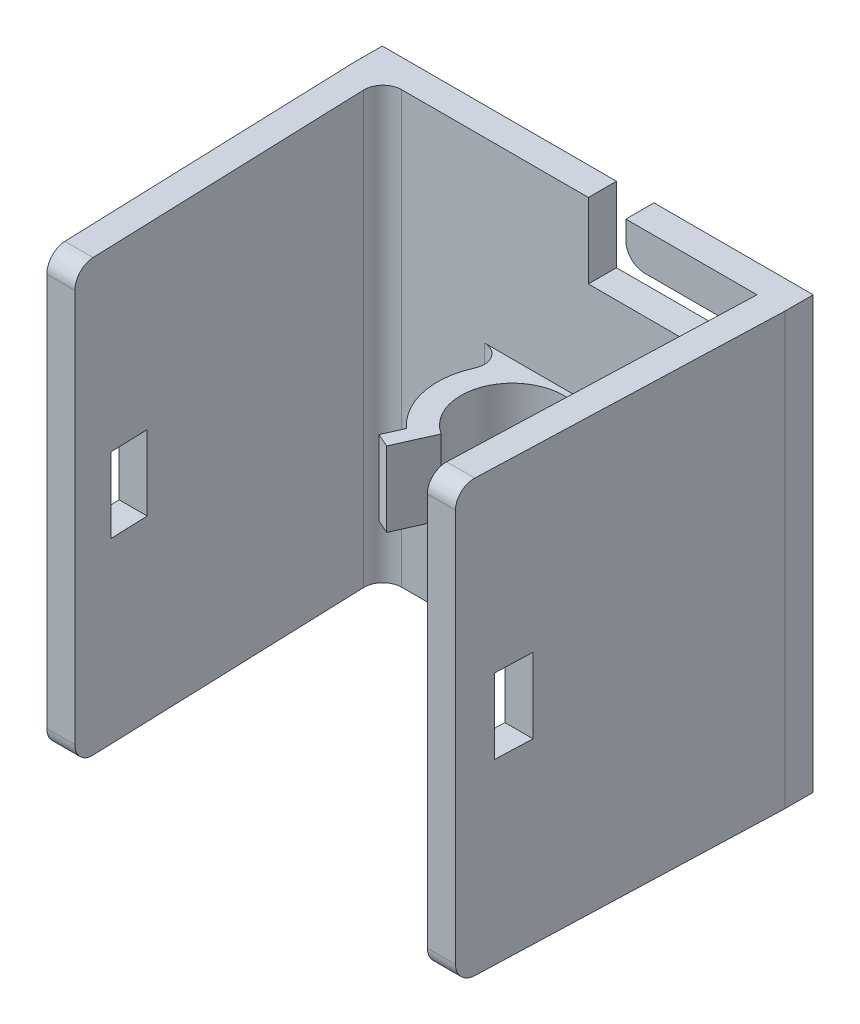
ISO-10303-21;
HEADER;
FILE_DESCRIPTION(('STEP AP214'),'2;1');
FILE_NAME('part.step','',(''),(''),'','','');
FILE_SCHEMA(('AUTOMOTIVE_DESIGN { 1 0 10303 214 1 1 1 1 }'));
ENDSEC;
DATA;
#1=APPLICATION_CONTEXT('core data for automotive mechanical design processes');
#2=APPLICATION_PROTOCOL_DEFINITION('international standard','automotive_design',2000,#1);
#3=PRODUCT_CONTEXT('',#1,'mechanical');
#4=PRODUCT('Part','Part','',(#3));
#5=PRODUCT_RELATED_PRODUCT_CATEGORY('part','',(#4));
#6=PRODUCT_DEFINITION_FORMATION('','',#4);
#7=PRODUCT_DEFINITION_CONTEXT('part definition',#1,'design');
#8=PRODUCT_DEFINITION('design','',#6,#7);
#9=PRODUCT_DEFINITION_SHAPE('','',#8);
#10=(LENGTH_UNIT() NAMED_UNIT(*) SI_UNIT(.MILLI.,.METRE.));
#11=(NAMED_UNIT(*) PLANE_ANGLE_UNIT() SI_UNIT($,.RADIAN.));
#12=(NAMED_UNIT(*) SI_UNIT($,.STERADIAN.) SOLID_ANGLE_UNIT());
#13=UNCERTAINTY_MEASURE_WITH_UNIT(LENGTH_MEASURE(1.E-05),#10,'distance_accuracy_value','');
#14=(GEOMETRIC_REPRESENTATION_CONTEXT(3) GLOBAL_UNCERTAINTY_ASSIGNED_CONTEXT((#13)) GLOBAL_UNIT_ASSIGNED_CONTEXT((#10,
#11,#12)) REPRESENTATION_CONTEXT('',''));
#15=CARTESIAN_POINT('',(0.,0.,0.));
#16=DIRECTION('',(0.,0.,1.));
#17=DIRECTION('',(1.,0.,0.));
#18=AXIS2_PLACEMENT_3D('',#15,#16,#17);
#19=CARTESIAN_POINT('',(0.,0.,1.5));
#20=DIRECTION('',(0.,0.,1.));
#21=DIRECTION('',(1.,0.,0.));
#22=AXIS2_PLACEMENT_3D('',#19,#20,#21);
#23=PLANE('',#22);
#24=DIRECTION('',(0.,1.,0.));
#25=VECTOR('',#24,1.);
#26=CARTESIAN_POINT('',(-10.3932305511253,0.,1.5));
#27=LINE('',#26,#25);
#28=CARTESIAN_POINT('',(-10.3932305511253,10.4128787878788,1.5));
#29=VERTEX_POINT('',#28);
#30=CARTESIAN_POINT('',(-10.3932305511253,11.4128787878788,1.5));
#31=VERTEX_POINT('',#30);
#32=EDGE_CURVE('E1235',#29,#31,#27,.T.);
#33=ORIENTED_EDGE('',*,*,#32,.F.);
#34=CARTESIAN_POINT('',(-9.3932305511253,10.4128787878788,1.5));
#35=DIRECTION('',(0.,0.,1.));
#36=DIRECTION('',(1.,0.,0.));
#37=AXIS2_PLACEMENT_3D('',#34,#35,#36);
#38=CIRCLE('',#37,1.);
#39=CARTESIAN_POINT('',(-9.3932305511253,9.41287878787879,1.5));
#40=VERTEX_POINT('',#39);
#41=EDGE_CURVE('E430',#29,#40,#38,.T.);
#42=ORIENTED_EDGE('',*,*,#41,.T.);
#43=DIRECTION('',(-1.,0.,0.));
#44=VECTOR('',#43,1.);
#45=CARTESIAN_POINT('',(0.,9.41287878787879,1.5));
#46=LINE('',#45,#44);
#47=CARTESIAN_POINT('',(-3.39323055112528,9.41287878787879,1.49999999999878));
#48=VERTEX_POINT('',#47);
#49=EDGE_CURVE('E571',#48,#40,#46,.T.);
#50=ORIENTED_EDGE('',*,*,#49,.F.);
#51=DIRECTION('',(0.,-1.,0.));
#52=VECTOR('',#51,1.);
#53=CARTESIAN_POINT('',(-3.3932305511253,11.4128787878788,1.5));
#54=LINE('',#53,#52);
#55=CARTESIAN_POINT('',(-3.3932305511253,11.4128787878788,1.5));
#56=VERTEX_POINT('',#55);
#57=EDGE_CURVE('E550',#56,#48,#54,.T.);
#58=ORIENTED_EDGE('',*,*,#57,.F.);
#59=DIRECTION('',(-1.,0.,0.));
#60=VECTOR('',#59,1.);
#61=CARTESIAN_POINT('',(-24.8932305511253,11.4128787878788,1.5));
#62=LINE('',#61,#60);
#63=EDGE_CURVE('E367',#56,#31,#62,.T.);
#64=ORIENTED_EDGE('',*,*,#63,.T.);
#65=EDGE_LOOP('',(#33,#42,#50,#58,#64));
#66=FACE_BOUND('',#65,.T.);
#67=ADVANCED_FACE('F33',(#66),#23,.T.);
#68=CARTESIAN_POINT('',(-24.8932305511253,11.4128787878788,1.5));
#69=DIRECTION('',(0.,-1.,0.));
#70=DIRECTION('',(0.,0.,-1.));
#71=AXIS2_PLACEMENT_3D('',#68,#69,#70);
#72=PLANE('',#71);
#73=DIRECTION('',(0.0348994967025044,0.,-0.999390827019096));
#74=VECTOR('',#73,1.);
#75=CARTESIAN_POINT('',(-3.98688363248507,11.4128787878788,18.5));
#76=LINE('',#75,#74);
#77=CARTESIAN_POINT('',(-3.95196286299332,11.4128787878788,17.5));
#78=VERTEX_POINT('',#77);
#79=EDGE_CURVE('E537',#78,#56,#76,.T.);
#80=ORIENTED_EDGE('',*,*,#79,.F.);
#81=DIRECTION('',(-1.,0.,0.));
#82=VECTOR('',#81,1.);
#83=CARTESIAN_POINT('',(-2.48688363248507,11.4128787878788,17.5));
#84=LINE('',#83,#82);
#85=CARTESIAN_POINT('',(-2.45196286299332,11.4128787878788,17.5));
#86=VERTEX_POINT('',#85);
#87=EDGE_CURVE('E470',#78,#86,#84,.F.);
#88=ORIENTED_EDGE('',*,*,#87,.T.);
#89=DIRECTION('',(-0.0348994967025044,0.,0.999390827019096));
#90=VECTOR('',#89,1.);
#91=CARTESIAN_POINT('',(-1.8932305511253,11.4128787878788,1.5));
#92=LINE('',#91,#90);
#93=CARTESIAN_POINT('',(-1.8932305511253,11.4128787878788,1.5));
#94=VERTEX_POINT('',#93);
#95=EDGE_CURVE('E529',#94,#86,#92,.T.);
#96=ORIENTED_EDGE('',*,*,#95,.F.);
#97=DIRECTION('',(0.,0.,-1.));
#98=VECTOR('',#97,1.);
#99=CARTESIAN_POINT('',(-1.8932305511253,11.4128787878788,1.5));
#100=LINE('',#99,#98);
#101=CARTESIAN_POINT('',(-1.8932305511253,11.4128787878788,0.));
#102=VERTEX_POINT('',#101);
#103=EDGE_CURVE('E366',#94,#102,#100,.T.);
#104=ORIENTED_EDGE('',*,*,#103,.T.);
#105=DIRECTION('',(-1.,0.,0.));
#106=VECTOR('',#105,1.);
#107=CARTESIAN_POINT('',(-24.8932305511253,11.4128787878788,0.));
#108=LINE('',#107,#106);
#109=CARTESIAN_POINT('',(-10.3932305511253,11.4128787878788,0.));
#110=VERTEX_POINT('',#109);
#111=EDGE_CURVE('E355',#102,#110,#108,.T.);
#112=ORIENTED_EDGE('',*,*,#111,.T.);
#113=DIRECTION('',(0.,0.,-1.));
#114=VECTOR('',#113,1.);
#115=CARTESIAN_POINT('',(-10.3932305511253,11.4128787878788,4.));
#116=LINE('',#115,#114);
#117=EDGE_CURVE('E347',#31,#110,#116,.T.);
#118=ORIENTED_EDGE('',*,*,#117,.F.);
#119=ORIENTED_EDGE('',*,*,#63,.F.);
#120=EDGE_LOOP('',(#80,#88,#96,#104,#112,#118,#119));
#121=FACE_BOUND('',#120,.T.);
#122=ADVANCED_FACE('F525',(#121),#72,.F.);
#123=CARTESIAN_POINT('',(-13.3932305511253,1.91287878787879,4.55724816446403));
#124=DIRECTION('',(0.,-1.,0.));
#125=DIRECTION('',(0.,0.,-1.));
#126=AXIS2_PLACEMENT_3D('',#123,#124,#125);
#127=CYLINDRICAL_SURFACE('',#126,4.);
#128=CARTESIAN_POINT('',(-13.3932305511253,-2.08712121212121,4.55724816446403));
#129=DIRECTION('',(0.,1.,0.));
#130=DIRECTION('',(0.,0.,1.));
#131=AXIS2_PLACEMENT_3D('',#128,#129,#130);
#132=CIRCLE('',#131,4.);
#133=CARTESIAN_POINT('',(-17.0389605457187,-2.08712121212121,2.9114496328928));
#134=VERTEX_POINT('',#133);
#135=CARTESIAN_POINT('',(-16.0655072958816,-2.08712121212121,7.53364481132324));
#136=VERTEX_POINT('',#135);
#137=EDGE_CURVE('E639',#134,#136,#132,.T.);
#138=ORIENTED_EDGE('',*,*,#137,.T.);
#139=DIRECTION('',(0.,-1.,0.));
#140=VECTOR('',#139,1.);
#141=CARTESIAN_POINT('',(-16.0655072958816,1.91287878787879,7.53364481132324));
#142=LINE('',#141,#140);
#143=CARTESIAN_POINT('',(-16.0655072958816,1.91287878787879,7.53364481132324));
#144=VERTEX_POINT('',#143);
#145=EDGE_CURVE('E613',#136,#144,#142,.F.);
#146=ORIENTED_EDGE('',*,*,#145,.T.);
#147=CARTESIAN_POINT('',(-13.3932305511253,1.91287878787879,4.55724816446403));
#148=DIRECTION('',(0.,1.,0.));
#149=DIRECTION('',(0.,0.,1.));
#150=AXIS2_PLACEMENT_3D('',#147,#148,#149);
#151=CIRCLE('',#150,4.);
#152=CARTESIAN_POINT('',(-17.0389605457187,1.91287878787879,2.9114496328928));
#153=VERTEX_POINT('',#152);
#154=EDGE_CURVE('E634',#153,#144,#151,.T.);
#155=ORIENTED_EDGE('',*,*,#154,.F.);
#156=DIRECTION('',(0.,-1.,0.));
#157=VECTOR('',#156,1.);
#158=CARTESIAN_POINT('',(-17.0389605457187,1.91287878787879,2.9114496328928));
#159=LINE('',#158,#157);
#160=EDGE_CURVE('E398',#153,#134,#159,.T.);
#161=ORIENTED_EDGE('',*,*,#160,.T.);
#162=EDGE_LOOP('',(#138,#146,#155,#161));
#163=FACE_BOUND('',#162,.T.);
#164=ADVANCED_FACE('F729',(#163),#127,.T.);
#165=DIRECTION('',(1.,0.,0.));
#166=VECTOR('',#165,1.);
#167=CARTESIAN_POINT('',(-24.8932305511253,-11.5871212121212,1.5));
#168=LINE('',#167,#166);
#169=CARTESIAN_POINT('',(-22.3577002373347,-11.5871212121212,1.5));
#170=VERTEX_POINT('',#169);
#171=CARTESIAN_POINT('',(-4.42876086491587,-11.5871212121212,1.5));
#172=VERTEX_POINT('',#171);
#173=EDGE_CURVE('E486',#170,#172,#168,.T.);
#174=ORIENTED_EDGE('',*,*,#173,.T.);
#175=DIRECTION('',(0.,-1.,0.));
#176=VECTOR('',#175,1.);
#177=CARTESIAN_POINT('',(-4.42876086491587,7.41287878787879,1.5));
#178=LINE('',#177,#176);
#179=CARTESIAN_POINT('',(-4.42876086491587,7.41287878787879,1.5));
#180=VERTEX_POINT('',#179);
#181=EDGE_CURVE('E56',#172,#180,#178,.F.);
#182=ORIENTED_EDGE('',*,*,#181,.T.);
#183=DIRECTION('',(1.,0.,0.));
#184=VECTOR('',#183,1.);
#185=CARTESIAN_POINT('',(0.,7.41287878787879,1.5));
#186=LINE('',#185,#184);
#187=CARTESIAN_POINT('',(-12.3932305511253,7.41287878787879,1.5));
#188=VERTEX_POINT('',#187);
#189=EDGE_CURVE('E570',#188,#180,#186,.T.);
#190=ORIENTED_EDGE('',*,*,#189,.F.);
#191=DIRECTION('',(0.,-1.,0.));
#192=VECTOR('',#191,1.);
#193=CARTESIAN_POINT('',(-12.3932305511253,0.,1.5));
#194=LINE('',#193,#192);
#195=CARTESIAN_POINT('',(-12.3932305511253,11.4128787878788,1.5));
#196=VERTEX_POINT('',#195);
#197=EDGE_CURVE('E503',#196,#188,#194,.T.);
#198=ORIENTED_EDGE('',*,*,#197,.F.);
#199=CARTESIAN_POINT('',(-22.3577002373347,11.4128787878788,1.5));
#200=VERTEX_POINT('',#199);
#201=EDGE_CURVE('E346',#196,#200,#62,.T.);
#202=ORIENTED_EDGE('',*,*,#201,.T.);
#203=DIRECTION('',(0.,-1.,0.));
#204=VECTOR('',#203,1.);
#205=CARTESIAN_POINT('',(-22.3577002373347,-11.5871212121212,1.5));
#206=LINE('',#205,#204);
#207=EDGE_CURVE('E472',#200,#170,#206,.T.);
#208=ORIENTED_EDGE('',*,*,#207,.T.);
#209=EDGE_LOOP('',(#174,#182,#190,#198,#202,#208));
#210=FACE_BOUND('',#209,.T.);
#211=DIRECTION('',(0.,-1.,0.));
#212=VECTOR('',#211,1.);
#213=CARTESIAN_POINT('',(-17.9503930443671,0.,1.5));
#214=LINE('',#213,#212);
#215=CARTESIAN_POINT('',(-17.9503930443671,-2.08712121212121,1.5));
#216=VERTEX_POINT('',#215);
#217=CARTESIAN_POINT('',(-17.9503930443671,1.91287878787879,1.5));
#218=VERTEX_POINT('',#217);
#219=EDGE_CURVE('E392',#216,#218,#214,.F.);
#220=ORIENTED_EDGE('',*,*,#219,.T.);
#221=DIRECTION('',(-1.,0.,0.));
#222=VECTOR('',#221,1.);
#223=CARTESIAN_POINT('',(0.,1.91287878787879,1.5));
#224=LINE('',#223,#222);
#225=CARTESIAN_POINT('',(-8.83606805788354,1.91287878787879,1.5));
#226=VERTEX_POINT('',#225);
#227=EDGE_CURVE('E387',#226,#218,#224,.T.);
#228=ORIENTED_EDGE('',*,*,#227,.F.);
#229=DIRECTION('',(0.,-1.,0.));
#230=VECTOR('',#229,1.);
#231=CARTESIAN_POINT('',(-8.83606805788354,0.,1.5));
#232=LINE('',#231,#230);
#233=CARTESIAN_POINT('',(-8.83606805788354,-2.08712121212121,1.5));
#234=VERTEX_POINT('',#233);
#235=EDGE_CURVE('E389',#226,#234,#232,.T.);
#236=ORIENTED_EDGE('',*,*,#235,.T.);
#237=DIRECTION('',(-1.,0.,0.));
#238=VECTOR('',#237,1.);
#239=CARTESIAN_POINT('',(0.,-2.08712121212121,1.5));
#240=LINE('',#239,#238);
#241=EDGE_CURVE('E385',#234,#216,#240,.T.);
#242=ORIENTED_EDGE('',*,*,#241,.T.);
#243=EDGE_LOOP('',(#220,#228,#236,#242));
#244=FACE_BOUND('',#243,.T.);
#245=ADVANCED_FACE('F501',(#210,#244),#23,.T.);
#246=CARTESIAN_POINT('',(-24.8932305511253,11.4128787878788,1.5));
#247=DIRECTION('',(1.,0.,0.));
#248=DIRECTION('',(0.,1.,0.));
#249=AXIS2_PLACEMENT_3D('',#246,#247,#248);
#250=PLANE('',#249);
#251=DIRECTION('',(0.,-1.,0.));
#252=VECTOR('',#251,1.);
#253=CARTESIAN_POINT('',(-24.8932305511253,11.4128787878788,0.));
#254=LINE('',#253,#252);
#255=CARTESIAN_POINT('',(-24.8932305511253,11.4128787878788,0.));
#256=VERTEX_POINT('',#255);
#257=CARTESIAN_POINT('',(-24.8932305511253,-11.5871212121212,0.));
#258=VERTEX_POINT('',#257);
#259=EDGE_CURVE('E354',#256,#258,#254,.T.);
#260=ORIENTED_EDGE('',*,*,#259,.T.);
#261=DIRECTION('',(0.,0.,-1.));
#262=VECTOR('',#261,1.);
#263=CARTESIAN_POINT('',(-24.8932305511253,-11.5871212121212,1.5));
#264=LINE('',#263,#262);
#265=CARTESIAN_POINT('',(-24.8932305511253,-11.5871212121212,1.5));
#266=VERTEX_POINT('',#265);
#267=EDGE_CURVE('E373',#266,#258,#264,.T.);
#268=ORIENTED_EDGE('',*,*,#267,.F.);
#269=DIRECTION('',(0.,-1.,0.));
#270=VECTOR('',#269,1.);
#271=CARTESIAN_POINT('',(-24.8932305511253,11.4128787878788,1.5));
#272=LINE('',#271,#270);
#273=CARTESIAN_POINT('',(-24.8932305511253,11.4128787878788,1.5));
#274=VERTEX_POINT('',#273);
#275=EDGE_CURVE('E359',#274,#266,#272,.T.);
#276=ORIENTED_EDGE('',*,*,#275,.F.);
#277=DIRECTION('',(0.,0.,-1.));
#278=VECTOR('',#277,1.);
#279=CARTESIAN_POINT('',(-24.8932305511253,11.4128787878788,1.5));
#280=LINE('',#279,#278);
#281=EDGE_CURVE('E364',#274,#256,#280,.T.);
#282=ORIENTED_EDGE('',*,*,#281,.T.);
#283=EDGE_LOOP('',(#260,#268,#276,#282));
#284=FACE_BOUND('',#283,.T.);
#285=ADVANCED_FACE('F735',(#284),#250,.F.);
#286=CARTESIAN_POINT('',(-24.8932305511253,-11.5871212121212,1.5));
#287=DIRECTION('',(0.,1.,0.));
#288=DIRECTION('',(0.,0.,1.));
#289=AXIS2_PLACEMENT_3D('',#286,#287,#288);
#290=PLANE('',#289);
#291=DIRECTION('',(0.0348994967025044,0.,0.999390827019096));
#292=VECTOR('',#291,1.);
#293=CARTESIAN_POINT('',(-22.7995774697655,-11.5871212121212,18.5));
#294=LINE('',#293,#292);
#295=CARTESIAN_POINT('',(-23.3570910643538,-11.5871212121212,2.53489949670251));
#296=VERTEX_POINT('',#295);
#297=CARTESIAN_POINT('',(-22.8344982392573,-11.5871212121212,17.5));
#298=VERTEX_POINT('',#297);
#299=EDGE_CURVE('E484',#296,#298,#294,.T.);
#300=ORIENTED_EDGE('',*,*,#299,.T.);
#301=DIRECTION('',(-1.,0.,0.));
#302=VECTOR('',#301,1.);
#303=CARTESIAN_POINT('',(-24.2995774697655,-11.5871212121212,17.5));
#304=LINE('',#303,#302);
#305=CARTESIAN_POINT('',(-24.3344982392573,-11.5871212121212,17.5));
#306=VERTEX_POINT('',#305);
#307=EDGE_CURVE('E435',#298,#306,#304,.T.);
#308=ORIENTED_EDGE('',*,*,#307,.T.);
#309=DIRECTION('',(-0.0348994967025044,0.,-0.999390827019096));
#310=VECTOR('',#309,1.);
#311=CARTESIAN_POINT('',(-24.8932305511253,-11.5871212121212,1.5));
#312=LINE('',#311,#310);
#313=EDGE_CURVE('E496',#306,#266,#312,.T.);
#314=ORIENTED_EDGE('',*,*,#313,.T.);
#315=ORIENTED_EDGE('',*,*,#267,.T.);
#316=DIRECTION('',(1.,0.,0.));
#317=VECTOR('',#316,1.);
#318=CARTESIAN_POINT('',(-24.8932305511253,-11.5871212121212,0.));
#319=LINE('',#318,#317);
#320=CARTESIAN_POINT('',(-1.8932305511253,-11.5871212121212,0.));
#321=VERTEX_POINT('',#320);
#322=EDGE_CURVE('E360',#258,#321,#319,.T.);
#323=ORIENTED_EDGE('',*,*,#322,.T.);
#324=DIRECTION('',(0.,0.,-1.));
#325=VECTOR('',#324,1.);
#326=CARTESIAN_POINT('',(-1.8932305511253,-11.5871212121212,1.5));
#327=LINE('',#326,#325);
#328=CARTESIAN_POINT('',(-1.8932305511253,-11.5871212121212,1.5));
#329=VERTEX_POINT('',#328);
#330=EDGE_CURVE('E370',#329,#321,#327,.T.);
#331=ORIENTED_EDGE('',*,*,#330,.F.);
#332=DIRECTION('',(-0.0348994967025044,0.,0.999390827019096));
#333=VECTOR('',#332,1.);
#334=CARTESIAN_POINT('',(-1.8932305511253,-11.5871212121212,1.5));
#335=LINE('',#334,#333);
#336=CARTESIAN_POINT('',(-2.45196286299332,-11.5871212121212,17.5));
#337=VERTEX_POINT('',#336);
#338=EDGE_CURVE('E534',#329,#337,#335,.T.);
#339=ORIENTED_EDGE('',*,*,#338,.T.);
#340=DIRECTION('',(-1.,0.,0.));
#341=VECTOR('',#340,1.);
#342=CARTESIAN_POINT('',(-3.98688363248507,-11.5871212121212,17.5));
#343=LINE('',#342,#341);
#344=CARTESIAN_POINT('',(-3.95196286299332,-11.5871212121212,17.5));
#345=VERTEX_POINT('',#344);
#346=EDGE_CURVE('E432',#337,#345,#343,.T.);
#347=ORIENTED_EDGE('',*,*,#346,.T.);
#348=DIRECTION('',(0.0348994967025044,0.,-0.999390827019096));
#349=VECTOR('',#348,1.);
#350=CARTESIAN_POINT('',(-3.98688363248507,-11.5871212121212,18.5));
#351=LINE('',#350,#349);
#352=CARTESIAN_POINT('',(-3.42937003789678,-11.5871212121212,2.53489949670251));
#353=VERTEX_POINT('',#352);
#354=EDGE_CURVE('E538',#345,#353,#351,.T.);
#355=ORIENTED_EDGE('',*,*,#354,.T.);
#356=CARTESIAN_POINT('',(-4.42876086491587,-11.5871212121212,2.5));
#357=DIRECTION('',(0.,1.,0.));
#358=DIRECTION('',(0.,0.,1.));
#359=AXIS2_PLACEMENT_3D('',#356,#357,#358);
#360=CIRCLE('',#359,1.);
#361=EDGE_CURVE('E476',#353,#172,#360,.T.);
#362=ORIENTED_EDGE('',*,*,#361,.T.);
#363=ORIENTED_EDGE('',*,*,#173,.F.);
#364=CARTESIAN_POINT('',(-22.3577002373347,-11.5871212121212,2.5));
#365=DIRECTION('',(0.,1.,0.));
#366=DIRECTION('',(0.,0.,1.));
#367=AXIS2_PLACEMENT_3D('',#364,#365,#366);
#368=CIRCLE('',#367,1.);
#369=EDGE_CURVE('E41',#170,#296,#368,.T.);
#370=ORIENTED_EDGE('',*,*,#369,.T.);
#371=EDGE_LOOP('',(#300,#308,#314,#315,#323,#331,#339,#347,#355,#362,#363,#370));
#372=FACE_BOUND('',#371,.T.);
#373=ADVANCED_FACE('F483',(#372),#290,.F.);
#374=CARTESIAN_POINT('',(-1.8932305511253,11.4128787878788,1.5));
#375=DIRECTION('',(-1.,0.,0.));
#376=DIRECTION('',(0.,-1.,0.));
#377=AXIS2_PLACEMENT_3D('',#374,#375,#376);
#378=PLANE('',#377);
#379=DIRECTION('',(0.,1.,0.));
#380=VECTOR('',#379,1.);
#381=CARTESIAN_POINT('',(-1.8932305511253,11.4128787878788,0.));
#382=LINE('',#381,#380);
#383=EDGE_CURVE('E356',#321,#102,#382,.T.);
#384=ORIENTED_EDGE('',*,*,#383,.T.);
#385=ORIENTED_EDGE('',*,*,#103,.F.);
#386=DIRECTION('',(0.,1.,0.));
#387=VECTOR('',#386,1.);
#388=CARTESIAN_POINT('',(-1.8932305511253,11.4128787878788,1.5));
#389=LINE('',#388,#387);
#390=EDGE_CURVE('E504',#329,#94,#389,.T.);
#391=ORIENTED_EDGE('',*,*,#390,.F.);
#392=ORIENTED_EDGE('',*,*,#330,.T.);
#393=EDGE_LOOP('',(#384,#385,#391,#392));
#394=FACE_BOUND('',#393,.T.);
#395=ADVANCED_FACE('F517',(#394),#378,.F.);
#396=DIRECTION('',(-0.0348994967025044,0.,-0.999390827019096));
#397=VECTOR('',#396,1.);
#398=CARTESIAN_POINT('',(-24.8932305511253,11.4128787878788,1.5));
#399=LINE('',#398,#397);
#400=CARTESIAN_POINT('',(-24.3344982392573,11.4128787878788,17.5));
#401=VERTEX_POINT('',#400);
#402=EDGE_CURVE('E554',#401,#274,#399,.T.);
#403=ORIENTED_EDGE('',*,*,#402,.F.);
#404=DIRECTION('',(-1.,0.,0.));
#405=VECTOR('',#404,1.);
#406=CARTESIAN_POINT('',(-22.7995774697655,11.4128787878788,17.5));
#407=LINE('',#406,#405);
#408=CARTESIAN_POINT('',(-22.8344982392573,11.4128787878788,17.5));
#409=VERTEX_POINT('',#408);
#410=EDGE_CURVE('E468',#401,#409,#407,.F.);
#411=ORIENTED_EDGE('',*,*,#410,.T.);
#412=DIRECTION('',(0.0348994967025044,0.,0.999390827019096));
#413=VECTOR('',#412,1.);
#414=CARTESIAN_POINT('',(-22.7995774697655,11.4128787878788,18.5));
#415=LINE('',#414,#413);
#416=CARTESIAN_POINT('',(-23.3570910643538,11.4128787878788,2.53489949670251));
#417=VERTEX_POINT('',#416);
#418=EDGE_CURVE('E500',#417,#409,#415,.T.);
#419=ORIENTED_EDGE('',*,*,#418,.F.);
#420=CARTESIAN_POINT('',(-22.3577002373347,11.4128787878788,2.5));
#421=DIRECTION('',(0.,-1.,0.));
#422=DIRECTION('',(0.,0.,-1.));
#423=AXIS2_PLACEMENT_3D('',#420,#421,#422);
#424=CIRCLE('',#423,1.);
#425=EDGE_CURVE('E11',#417,#200,#424,.T.);
#426=ORIENTED_EDGE('',*,*,#425,.T.);
#427=ORIENTED_EDGE('',*,*,#201,.F.);
#428=DIRECTION('',(0.,0.,-1.));
#429=VECTOR('',#428,1.);
#430=CARTESIAN_POINT('',(-12.3932305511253,11.4128787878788,4.));
#431=LINE('',#430,#429);
#432=CARTESIAN_POINT('',(-12.3932305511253,11.4128787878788,0.));
#433=VERTEX_POINT('',#432);
#434=EDGE_CURVE('E328',#196,#433,#431,.T.);
#435=ORIENTED_EDGE('',*,*,#434,.T.);
#436=EDGE_CURVE('E343',#433,#256,#108,.T.);
#437=ORIENTED_EDGE('',*,*,#436,.T.);
#438=ORIENTED_EDGE('',*,*,#281,.F.);
#439=EDGE_LOOP('',(#403,#411,#419,#426,#427,#435,#437,#438));
#440=FACE_BOUND('',#439,.T.);
#441=ADVANCED_FACE('F341',(#440),#72,.F.);
#442=CARTESIAN_POINT('',(0.,0.,0.));
#443=DIRECTION('',(0.,0.,1.));
#444=DIRECTION('',(1.,0.,0.));
#445=AXIS2_PLACEMENT_3D('',#442,#443,#444);
#446=PLANE('',#445);
#447=DIRECTION('',(1.,0.,0.));
#448=VECTOR('',#447,1.);
#449=CARTESIAN_POINT('',(-3.3932305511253,9.41287878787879,0.));
#450=LINE('',#449,#448);
#451=CARTESIAN_POINT('',(-9.3932305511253,9.41287878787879,0.));
#452=VERTEX_POINT('',#451);
#453=CARTESIAN_POINT('',(-3.3932305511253,9.41287878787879,0.));
#454=VERTEX_POINT('',#453);
#455=EDGE_CURVE('E336',#452,#454,#450,.T.);
#456=ORIENTED_EDGE('',*,*,#455,.F.);
#457=CARTESIAN_POINT('',(-9.3932305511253,10.4128787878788,0.));
#458=DIRECTION('',(0.,0.,1.));
#459=DIRECTION('',(1.,0.,0.));
#460=AXIS2_PLACEMENT_3D('',#457,#458,#459);
#461=CIRCLE('',#460,1.);
#462=CARTESIAN_POINT('',(-10.3932305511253,10.4128787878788,0.));
#463=VERTEX_POINT('',#462);
#464=EDGE_CURVE('E426',#452,#463,#461,.F.);
#465=ORIENTED_EDGE('',*,*,#464,.T.);
#466=DIRECTION('',(0.,-1.,0.));
#467=VECTOR('',#466,1.);
#468=CARTESIAN_POINT('',(-10.3932305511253,9.41287878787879,0.));
#469=LINE('',#468,#467);
#470=EDGE_CURVE('E348',#110,#463,#469,.T.);
#471=ORIENTED_EDGE('',*,*,#470,.F.);
#472=ORIENTED_EDGE('',*,*,#111,.F.);
#473=ORIENTED_EDGE('',*,*,#383,.F.);
#474=ORIENTED_EDGE('',*,*,#322,.F.);
#475=ORIENTED_EDGE('',*,*,#259,.F.);
#476=ORIENTED_EDGE('',*,*,#436,.F.);
#477=DIRECTION('',(0.,1.,0.));
#478=VECTOR('',#477,1.);
#479=CARTESIAN_POINT('',(-12.3932305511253,9.41287878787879,0.));
#480=LINE('',#479,#478);
#481=CARTESIAN_POINT('',(-12.3932305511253,7.41287878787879,0.));
#482=VERTEX_POINT('',#481);
#483=EDGE_CURVE('E325',#482,#433,#480,.T.);
#484=ORIENTED_EDGE('',*,*,#483,.F.);
#485=DIRECTION('',(-1.,0.,0.));
#486=VECTOR('',#485,1.);
#487=CARTESIAN_POINT('',(-3.3932305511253,7.41287878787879,0.));
#488=LINE('',#487,#486);
#489=CARTESIAN_POINT('',(-3.3932305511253,7.41287878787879,0.));
#490=VERTEX_POINT('',#489);
#491=EDGE_CURVE('E337',#490,#482,#488,.T.);
#492=ORIENTED_EDGE('',*,*,#491,.F.);
#493=DIRECTION('',(0.,-1.,0.));
#494=VECTOR('',#493,1.);
#495=CARTESIAN_POINT('',(-3.3932305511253,9.41287878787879,0.));
#496=LINE('',#495,#494);
#497=EDGE_CURVE('E1230',#454,#490,#496,.T.);
#498=ORIENTED_EDGE('',*,*,#497,.F.);
#499=EDGE_LOOP('',(#456,#465,#471,#472,#473,#474,#475,#476,#484,#492,#498));
#500=FACE_BOUND('',#499,.T.);
#501=ADVANCED_FACE('F352',(#500),#446,.F.);
#502=CARTESIAN_POINT('',(-24.8932305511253,11.4128787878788,1.5));
#503=DIRECTION('',(-0.999390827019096,0.,0.0348994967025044));
#504=DIRECTION('',(0.0348994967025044,0.,0.999390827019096));
#505=AXIS2_PLACEMENT_3D('',#502,#503,#504);
#506=PLANE('',#505);
#507=DIRECTION('',(0.,1.,0.));
#508=VECTOR('',#507,1.);
#509=CARTESIAN_POINT('',(-24.369419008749,11.4128787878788,16.5));
#510=LINE('',#509,#508);
#511=CARTESIAN_POINT('',(-24.369419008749,-2.08712121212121,16.5));
#512=VERTEX_POINT('',#511);
#513=CARTESIAN_POINT('',(-24.369419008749,1.91287878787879,16.5));
#514=VERTEX_POINT('',#513);
#515=EDGE_CURVE('E542',#512,#514,#510,.T.);
#516=ORIENTED_EDGE('',*,*,#515,.F.);
#517=DIRECTION('',(0.0348994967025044,0.,0.999390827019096));
#518=VECTOR('',#517,1.);
#519=CARTESIAN_POINT('',(-24.8932305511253,-2.08712121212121,1.5));
#520=LINE('',#519,#518);
#521=CARTESIAN_POINT('',(-24.4392605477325,-2.08712121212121,14.5));
#522=VERTEX_POINT('',#521);
#523=EDGE_CURVE('E660',#522,#512,#520,.T.);
#524=ORIENTED_EDGE('',*,*,#523,.F.);
#525=DIRECTION('',(0.,-1.,0.));
#526=VECTOR('',#525,1.);
#527=CARTESIAN_POINT('',(-24.4392605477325,11.4128787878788,14.5));
#528=LINE('',#527,#526);
#529=CARTESIAN_POINT('',(-24.4392605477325,1.91287878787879,14.5));
#530=VERTEX_POINT('',#529);
#531=EDGE_CURVE('E667',#530,#522,#528,.T.);
#532=ORIENTED_EDGE('',*,*,#531,.F.);
#533=DIRECTION('',(-0.0348994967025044,0.,-0.999390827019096));
#534=VECTOR('',#533,1.);
#535=CARTESIAN_POINT('',(-24.8932305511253,1.91287878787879,1.5));
#536=LINE('',#535,#534);
#537=EDGE_CURVE('E674',#514,#530,#536,.T.);
#538=ORIENTED_EDGE('',*,*,#537,.F.);
#539=EDGE_LOOP('',(#516,#524,#532,#538));
#540=FACE_BOUND('',#539,.T.);
#541=ORIENTED_EDGE('',*,*,#313,.F.);
#542=CARTESIAN_POINT('',(-24.3344982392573,-10.5871212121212,17.5));
#543=DIRECTION('',(-0.999390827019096,0.,0.0348994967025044));
#544=DIRECTION('',(0.0348994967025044,0.,0.999390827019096));
#545=AXIS2_PLACEMENT_3D('',#542,#543,#544);
#546=ELLIPSE('',#545,1.00060954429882,1.);
#547=CARTESIAN_POINT('',(-24.2995774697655,-10.5871212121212,18.5));
#548=VERTEX_POINT('',#547);
#549=EDGE_CURVE('E440',#306,#548,#546,.T.);
#550=ORIENTED_EDGE('',*,*,#549,.T.);
#551=DIRECTION('',(0.,-1.,0.));
#552=VECTOR('',#551,1.);
#553=CARTESIAN_POINT('',(-24.2995774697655,11.4128787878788,18.5));
#554=LINE('',#553,#552);
#555=CARTESIAN_POINT('',(-24.2995774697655,10.4128787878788,18.5));
#556=VERTEX_POINT('',#555);
#557=EDGE_CURVE('E511',#556,#548,#554,.T.);
#558=ORIENTED_EDGE('',*,*,#557,.F.);
#559=CARTESIAN_POINT('',(-24.3344982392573,10.4128787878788,17.5));
#560=DIRECTION('',(-0.999390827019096,0.,0.0348994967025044));
#561=DIRECTION('',(0.0348994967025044,0.,0.999390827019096));
#562=AXIS2_PLACEMENT_3D('',#559,#560,#561);
#563=ELLIPSE('',#562,1.00060954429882,1.);
#564=EDGE_CURVE('E438',#556,#401,#563,.T.);
#565=ORIENTED_EDGE('',*,*,#564,.T.);
#566=ORIENTED_EDGE('',*,*,#402,.T.);
#567=ORIENTED_EDGE('',*,*,#275,.T.);
#568=EDGE_LOOP('',(#541,#550,#558,#565,#566,#567));
#569=FACE_BOUND('',#568,.T.);
#570=ADVANCED_FACE('F697',(#540,#569),#506,.T.);
#571=CARTESIAN_POINT('',(-24.2995774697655,11.4128787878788,18.5));
#572=DIRECTION('',(0.,0.,1.));
#573=DIRECTION('',(1.,0.,0.));
#574=AXIS2_PLACEMENT_3D('',#571,#572,#573);
#575=PLANE('',#574);
#576=ORIENTED_EDGE('',*,*,#557,.T.);
#577=DIRECTION('',(-1.,0.,0.));
#578=VECTOR('',#577,1.);
#579=CARTESIAN_POINT('',(-22.7995774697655,-10.5871212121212,18.5));
#580=LINE('',#579,#578);
#581=CARTESIAN_POINT('',(-22.7995774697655,-10.5871212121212,18.5));
#582=VERTEX_POINT('',#581);
#583=EDGE_CURVE('E445',#548,#582,#580,.F.);
#584=ORIENTED_EDGE('',*,*,#583,.T.);
#585=DIRECTION('',(0.,-1.,0.));
#586=VECTOR('',#585,1.);
#587=CARTESIAN_POINT('',(-22.7995774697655,11.4128787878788,18.5));
#588=LINE('',#587,#586);
#589=CARTESIAN_POINT('',(-22.7995774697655,10.4128787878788,18.5));
#590=VERTEX_POINT('',#589);
#591=EDGE_CURVE('E555',#590,#582,#588,.T.);
#592=ORIENTED_EDGE('',*,*,#591,.F.);
#593=DIRECTION('',(-1.,0.,0.));
#594=VECTOR('',#593,1.);
#595=CARTESIAN_POINT('',(-24.2995774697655,10.4128787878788,18.5));
#596=LINE('',#595,#594);
#597=EDGE_CURVE('E442',#590,#556,#596,.T.);
#598=ORIENTED_EDGE('',*,*,#597,.T.);
#599=EDGE_LOOP('',(#576,#584,#592,#598));
#600=FACE_BOUND('',#599,.T.);
#601=ADVANCED_FACE('F945',(#600),#575,.T.);
#602=CARTESIAN_POINT('',(-22.7995774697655,11.4128787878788,18.5));
#603=DIRECTION('',(0.999390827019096,0.,-0.0348994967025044));
#604=DIRECTION('',(-0.0348994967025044,0.,-0.999390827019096));
#605=AXIS2_PLACEMENT_3D('',#602,#603,#604);
#606=PLANE('',#605);
#607=DIRECTION('',(0.,-1.,0.));
#608=VECTOR('',#607,1.);
#609=CARTESIAN_POINT('',(-22.869419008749,11.4128787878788,16.5));
#610=LINE('',#609,#608);
#611=CARTESIAN_POINT('',(-22.869419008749,1.91287878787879,16.5));
#612=VERTEX_POINT('',#611);
#613=CARTESIAN_POINT('',(-22.869419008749,-2.08712121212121,16.5));
#614=VERTEX_POINT('',#613);
#615=EDGE_CURVE('E678',#612,#614,#610,.T.);
#616=ORIENTED_EDGE('',*,*,#615,.F.);
#617=DIRECTION('',(0.0348994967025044,0.,0.999390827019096));
#618=VECTOR('',#617,1.);
#619=CARTESIAN_POINT('',(-22.7995774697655,1.91287878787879,18.5));
#620=LINE('',#619,#618);
#621=CARTESIAN_POINT('',(-22.9392605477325,1.91287878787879,14.5));
#622=VERTEX_POINT('',#621);
#623=EDGE_CURVE('E672',#622,#612,#620,.T.);
#624=ORIENTED_EDGE('',*,*,#623,.F.);
#625=DIRECTION('',(0.,1.,0.));
#626=VECTOR('',#625,1.);
#627=CARTESIAN_POINT('',(-22.9392605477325,11.4128787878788,14.5));
#628=LINE('',#627,#626);
#629=CARTESIAN_POINT('',(-22.9392605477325,-2.08712121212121,14.5));
#630=VERTEX_POINT('',#629);
#631=EDGE_CURVE('E665',#630,#622,#628,.T.);
#632=ORIENTED_EDGE('',*,*,#631,.F.);
#633=DIRECTION('',(-0.0348994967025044,0.,-0.999390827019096));
#634=VECTOR('',#633,1.);
#635=CARTESIAN_POINT('',(-22.7995774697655,-2.08712121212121,18.5));
#636=LINE('',#635,#634);
#637=EDGE_CURVE('E658',#614,#630,#636,.T.);
#638=ORIENTED_EDGE('',*,*,#637,.F.);
#639=EDGE_LOOP('',(#616,#624,#632,#638));
#640=FACE_BOUND('',#639,.T.);
#641=ORIENTED_EDGE('',*,*,#591,.T.);
#642=CARTESIAN_POINT('',(-22.8344982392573,-10.5871212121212,17.5));
#643=DIRECTION('',(0.999390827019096,0.,-0.0348994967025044));
#644=DIRECTION('',(0.0348994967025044,0.,0.999390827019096));
#645=AXIS2_PLACEMENT_3D('',#642,#643,#644);
#646=ELLIPSE('',#645,1.00060954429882,1.);
#647=EDGE_CURVE('E451',#582,#298,#646,.T.);
#648=ORIENTED_EDGE('',*,*,#647,.T.);
#649=ORIENTED_EDGE('',*,*,#299,.F.);
#650=DIRECTION('',(0.,-1.,0.));
#651=VECTOR('',#650,1.);
#652=CARTESIAN_POINT('',(-23.3570910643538,11.4128787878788,2.5348994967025));
#653=LINE('',#652,#651);
#654=EDGE_CURVE('E447',#296,#417,#653,.F.);
#655=ORIENTED_EDGE('',*,*,#654,.T.);
#656=ORIENTED_EDGE('',*,*,#418,.T.);
#657=CARTESIAN_POINT('',(-22.8344982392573,10.4128787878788,17.5));
#658=DIRECTION('',(0.999390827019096,0.,-0.0348994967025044));
#659=DIRECTION('',(0.0348994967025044,0.,0.999390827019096));
#660=AXIS2_PLACEMENT_3D('',#657,#658,#659);
#661=ELLIPSE('',#660,1.00060954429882,1.);
#662=EDGE_CURVE('E449',#409,#590,#661,.T.);
#663=ORIENTED_EDGE('',*,*,#662,.T.);
#664=EDGE_LOOP('',(#641,#648,#649,#655,#656,#663));
#665=FACE_BOUND('',#664,.T.);
#666=ADVANCED_FACE('F492',(#640,#665),#606,.T.);
#667=CARTESIAN_POINT('',(-3.98688363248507,11.4128787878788,18.5));
#668=DIRECTION('',(-0.999390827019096,0.,-0.0348994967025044));
#669=DIRECTION('',(-0.0348994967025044,0.,0.999390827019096));
#670=AXIS2_PLACEMENT_3D('',#667,#668,#669);
#671=PLANE('',#670);
#672=ORIENTED_EDGE('',*,*,#354,.F.);
#673=CARTESIAN_POINT('',(-3.95196286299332,-10.5871212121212,17.5));
#674=DIRECTION('',(-0.999390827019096,0.,-0.0348994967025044));
#675=DIRECTION('',(0.0348994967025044,0.,-0.999390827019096));
#676=AXIS2_PLACEMENT_3D('',#673,#674,#675);
#677=ELLIPSE('',#676,1.00060954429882,1.);
#678=CARTESIAN_POINT('',(-3.98688363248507,-10.5871212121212,18.5));
#679=VERTEX_POINT('',#678);
#680=EDGE_CURVE('E457',#345,#679,#677,.T.);
#681=ORIENTED_EDGE('',*,*,#680,.T.);
#682=DIRECTION('',(0.,-1.,0.));
#683=VECTOR('',#682,1.);
#684=CARTESIAN_POINT('',(-3.98688363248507,11.4128787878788,18.5));
#685=LINE('',#684,#683);
#686=CARTESIAN_POINT('',(-3.98688363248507,10.4128787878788,18.5));
#687=VERTEX_POINT('',#686);
#688=EDGE_CURVE('E497',#687,#679,#685,.T.);
#689=ORIENTED_EDGE('',*,*,#688,.F.);
#690=CARTESIAN_POINT('',(-3.95196286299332,10.4128787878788,17.5));
#691=DIRECTION('',(-0.999390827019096,0.,-0.0348994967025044));
#692=DIRECTION('',(0.0348994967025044,0.,-0.999390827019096));
#693=AXIS2_PLACEMENT_3D('',#690,#691,#692);
#694=ELLIPSE('',#693,1.00060954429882,1.);
#695=EDGE_CURVE('E455',#687,#78,#694,.T.);
#696=ORIENTED_EDGE('',*,*,#695,.T.);
#697=ORIENTED_EDGE('',*,*,#79,.T.);
#698=ORIENTED_EDGE('',*,*,#57,.T.);
#699=DIRECTION('',(0.0348994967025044,0.,-0.999390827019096));
#700=VECTOR('',#699,1.);
#701=CARTESIAN_POINT('',(-3.98688363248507,9.41287878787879,18.5));
#702=LINE('',#701,#700);
#703=CARTESIAN_POINT('',(-3.48053247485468,9.41287878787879,4.));
#704=VERTEX_POINT('',#703);
#705=EDGE_CURVE('E421',#704,#48,#702,.T.);
#706=ORIENTED_EDGE('',*,*,#705,.F.);
#707=DIRECTION('',(0.,-1.,0.));
#708=VECTOR('',#707,1.);
#709=CARTESIAN_POINT('',(-3.48053247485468,11.4128787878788,4.));
#710=LINE('',#709,#708);
#711=CARTESIAN_POINT('',(-3.48053247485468,7.41287878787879,4.));
#712=VERTEX_POINT('',#711);
#713=EDGE_CURVE('E418',#704,#712,#710,.T.);
#714=ORIENTED_EDGE('',*,*,#713,.T.);
#715=DIRECTION('',(-0.0348994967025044,0.,0.999390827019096));
#716=VECTOR('',#715,1.);
#717=CARTESIAN_POINT('',(-3.98688363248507,7.41287878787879,18.5));
#718=LINE('',#717,#716);
#719=CARTESIAN_POINT('',(-3.42937003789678,7.41287878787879,2.5348994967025));
#720=VERTEX_POINT('',#719);
#721=EDGE_CURVE('E48',#720,#712,#718,.T.);
#722=ORIENTED_EDGE('',*,*,#721,.F.);
#723=DIRECTION('',(0.,-1.,0.));
#724=VECTOR('',#723,1.);
#725=CARTESIAN_POINT('',(-3.42937003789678,-11.5871212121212,2.5348994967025));
#726=LINE('',#725,#724);
#727=EDGE_CURVE('E453',#720,#353,#726,.T.);
#728=ORIENTED_EDGE('',*,*,#727,.T.);
#729=EDGE_LOOP('',(#672,#681,#689,#696,#697,#698,#706,#714,#722,#728));
#730=FACE_BOUND('',#729,.T.);
#731=DIRECTION('',(0.,1.,0.));
#732=VECTOR('',#731,1.);
#733=CARTESIAN_POINT('',(-3.91704209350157,11.4128787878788,16.5));
#734=LINE('',#733,#732);
#735=CARTESIAN_POINT('',(-3.91704209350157,-2.08712121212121,16.5));
#736=VERTEX_POINT('',#735);
#737=CARTESIAN_POINT('',(-3.91704209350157,1.91287878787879,16.5));
#738=VERTEX_POINT('',#737);
#739=EDGE_CURVE('E676',#736,#738,#734,.T.);
#740=ORIENTED_EDGE('',*,*,#739,.F.);
#741=DIRECTION('',(-0.0348994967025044,0.,0.999390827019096));
#742=VECTOR('',#741,1.);
#743=CARTESIAN_POINT('',(-3.98688363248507,-2.08712121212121,18.5));
#744=LINE('',#743,#742);
#745=CARTESIAN_POINT('',(-3.84720055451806,-2.08712121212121,14.5));
#746=VERTEX_POINT('',#745);
#747=EDGE_CURVE('E656',#746,#736,#744,.T.);
#748=ORIENTED_EDGE('',*,*,#747,.F.);
#749=DIRECTION('',(0.,-1.,0.));
#750=VECTOR('',#749,1.);
#751=CARTESIAN_POINT('',(-3.84720055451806,11.4128787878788,14.5));
#752=LINE('',#751,#750);
#753=CARTESIAN_POINT('',(-3.84720055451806,1.91287878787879,14.5));
#754=VERTEX_POINT('',#753);
#755=EDGE_CURVE('E662',#754,#746,#752,.T.);
#756=ORIENTED_EDGE('',*,*,#755,.F.);
#757=DIRECTION('',(0.0348994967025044,0.,-0.999390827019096));
#758=VECTOR('',#757,1.);
#759=CARTESIAN_POINT('',(-3.98688363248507,1.91287878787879,18.5));
#760=LINE('',#759,#758);
#761=EDGE_CURVE('E670',#738,#754,#760,.T.);
#762=ORIENTED_EDGE('',*,*,#761,.F.);
#763=EDGE_LOOP('',(#740,#748,#756,#762));
#764=FACE_BOUND('',#763,.T.);
#765=ADVANCED_FACE('F927',(#730,#764),#671,.T.);
#766=CARTESIAN_POINT('',(-2.48688363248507,11.4128787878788,18.5));
#767=DIRECTION('',(0.,0.,1.));
#768=DIRECTION('',(1.,0.,0.));
#769=AXIS2_PLACEMENT_3D('',#766,#767,#768);
#770=PLANE('',#769);
#771=ORIENTED_EDGE('',*,*,#688,.T.);
#772=DIRECTION('',(-1.,0.,0.));
#773=VECTOR('',#772,1.);
#774=CARTESIAN_POINT('',(-2.48688363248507,-10.5871212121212,18.5));
#775=LINE('',#774,#773);
#776=CARTESIAN_POINT('',(-2.48688363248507,-10.5871212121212,18.5));
#777=VERTEX_POINT('',#776);
#778=EDGE_CURVE('E462',#679,#777,#775,.F.);
#779=ORIENTED_EDGE('',*,*,#778,.T.);
#780=DIRECTION('',(0.,-1.,0.));
#781=VECTOR('',#780,1.);
#782=CARTESIAN_POINT('',(-2.48688363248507,11.4128787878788,18.5));
#783=LINE('',#782,#781);
#784=CARTESIAN_POINT('',(-2.48688363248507,10.4128787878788,18.5));
#785=VERTEX_POINT('',#784);
#786=EDGE_CURVE('E548',#785,#777,#783,.T.);
#787=ORIENTED_EDGE('',*,*,#786,.F.);
#788=DIRECTION('',(-1.,0.,0.));
#789=VECTOR('',#788,1.);
#790=CARTESIAN_POINT('',(-3.98688363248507,10.4128787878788,18.5));
#791=LINE('',#790,#789);
#792=EDGE_CURVE('E459',#785,#687,#791,.T.);
#793=ORIENTED_EDGE('',*,*,#792,.T.);
#794=EDGE_LOOP('',(#771,#779,#787,#793));
#795=FACE_BOUND('',#794,.T.);
#796=ADVANCED_FACE('F916',(#795),#770,.T.);
#797=CARTESIAN_POINT('',(-1.8932305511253,11.4128787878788,1.5));
#798=DIRECTION('',(0.999390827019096,0.,0.0348994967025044));
#799=DIRECTION('',(0.0348994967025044,0.,-0.999390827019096));
#800=AXIS2_PLACEMENT_3D('',#797,#798,#799);
#801=PLANE('',#800);
#802=DIRECTION('',(0.,-1.,0.));
#803=VECTOR('',#802,1.);
#804=CARTESIAN_POINT('',(-2.41704209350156,11.4128787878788,16.5));
#805=LINE('',#804,#803);
#806=CARTESIAN_POINT('',(-2.41704209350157,1.91287878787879,16.5));
#807=VERTEX_POINT('',#806);
#808=CARTESIAN_POINT('',(-2.41704209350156,-2.08712121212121,16.5));
#809=VERTEX_POINT('',#808);
#810=EDGE_CURVE('E382',#807,#809,#805,.T.);
#811=ORIENTED_EDGE('',*,*,#810,.F.);
#812=DIRECTION('',(-0.0348994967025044,0.,0.999390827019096));
#813=VECTOR('',#812,1.);
#814=CARTESIAN_POINT('',(-1.8932305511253,1.91287878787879,1.5));
#815=LINE('',#814,#813);
#816=CARTESIAN_POINT('',(-2.34720055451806,1.91287878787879,14.5));
#817=VERTEX_POINT('',#816);
#818=EDGE_CURVE('E380',#817,#807,#815,.T.);
#819=ORIENTED_EDGE('',*,*,#818,.F.);
#820=DIRECTION('',(0.,1.,0.));
#821=VECTOR('',#820,1.);
#822=CARTESIAN_POINT('',(-2.34720055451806,11.4128787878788,14.5));
#823=LINE('',#822,#821);
#824=CARTESIAN_POINT('',(-2.34720055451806,-2.08712121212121,14.5));
#825=VERTEX_POINT('',#824);
#826=EDGE_CURVE('E378',#825,#817,#823,.T.);
#827=ORIENTED_EDGE('',*,*,#826,.F.);
#828=DIRECTION('',(0.0348994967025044,0.,-0.999390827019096));
#829=VECTOR('',#828,1.);
#830=CARTESIAN_POINT('',(-1.8932305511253,-2.08712121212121,1.5));
#831=LINE('',#830,#829);
#832=EDGE_CURVE('E376',#809,#825,#831,.T.);
#833=ORIENTED_EDGE('',*,*,#832,.F.);
#834=EDGE_LOOP('',(#811,#819,#827,#833));
#835=FACE_BOUND('',#834,.T.);
#836=ORIENTED_EDGE('',*,*,#786,.T.);
#837=CARTESIAN_POINT('',(-2.45196286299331,-10.5871212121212,17.5));
#838=DIRECTION('',(0.999390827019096,0.,0.0348994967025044));
#839=DIRECTION('',(0.0348994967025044,0.,-0.999390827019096));
#840=AXIS2_PLACEMENT_3D('',#837,#838,#839);
#841=ELLIPSE('',#840,1.00060954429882,1.);
#842=EDGE_CURVE('E466',#777,#337,#841,.T.);
#843=ORIENTED_EDGE('',*,*,#842,.T.);
#844=ORIENTED_EDGE('',*,*,#338,.F.);
#845=ORIENTED_EDGE('',*,*,#390,.T.);
#846=ORIENTED_EDGE('',*,*,#95,.T.);
#847=CARTESIAN_POINT('',(-2.45196286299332,10.4128787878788,17.5));
#848=DIRECTION('',(0.999390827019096,0.,0.0348994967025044));
#849=DIRECTION('',(0.0348994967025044,0.,-0.999390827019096));
#850=AXIS2_PLACEMENT_3D('',#847,#848,#849);
#851=ELLIPSE('',#850,1.00060954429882,1.);
#852=EDGE_CURVE('E464',#86,#785,#851,.T.);
#853=ORIENTED_EDGE('',*,*,#852,.T.);
#854=EDGE_LOOP('',(#836,#843,#844,#845,#846,#853));
#855=FACE_BOUND('',#854,.T.);
#856=ADVANCED_FACE('F532',(#835,#855),#801,.T.);
#857=CARTESIAN_POINT('',(-24.8932305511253,-2.08712121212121,16.5));
#858=DIRECTION('',(0.,-1.,0.));
#859=DIRECTION('',(0.,0.,-1.));
#860=AXIS2_PLACEMENT_3D('',#857,#858,#859);
#861=PLANE('',#860);
#862=ORIENTED_EDGE('',*,*,#747,.T.);
#863=DIRECTION('',(1.,0.,0.));
#864=VECTOR('',#863,1.);
#865=CARTESIAN_POINT('',(-24.8932305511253,-2.08712121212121,16.5));
#866=LINE('',#865,#864);
#867=EDGE_CURVE('E637',#736,#809,#866,.T.);
#868=ORIENTED_EDGE('',*,*,#867,.T.);
#869=ORIENTED_EDGE('',*,*,#832,.T.);
#870=DIRECTION('',(1.,0.,0.));
#871=VECTOR('',#870,1.);
#872=CARTESIAN_POINT('',(-24.8932305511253,-2.08712121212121,14.5));
#873=LINE('',#872,#871);
#874=EDGE_CURVE('E651',#746,#825,#873,.T.);
#875=ORIENTED_EDGE('',*,*,#874,.F.);
#876=EDGE_LOOP('',(#862,#868,#869,#875));
#877=FACE_BOUND('',#876,.T.);
#878=ADVANCED_FACE('F710',(#877),#861,.F.);
#879=CARTESIAN_POINT('',(-24.8932305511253,1.91287878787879,14.5));
#880=DIRECTION('',(0.,0.,-1.));
#881=DIRECTION('',(-1.,0.,0.));
#882=AXIS2_PLACEMENT_3D('',#879,#880,#881);
#883=PLANE('',#882);
#884=ORIENTED_EDGE('',*,*,#755,.T.);
#885=ORIENTED_EDGE('',*,*,#874,.T.);
#886=ORIENTED_EDGE('',*,*,#826,.T.);
#887=DIRECTION('',(1.,0.,0.));
#888=VECTOR('',#887,1.);
#889=CARTESIAN_POINT('',(-24.8932305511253,1.91287878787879,14.5));
#890=LINE('',#889,#888);
#891=EDGE_CURVE('E647',#754,#817,#890,.T.);
#892=ORIENTED_EDGE('',*,*,#891,.F.);
#893=EDGE_LOOP('',(#884,#885,#886,#892));
#894=FACE_BOUND('',#893,.T.);
#895=ADVANCED_FACE('F719',(#894),#883,.F.);
#896=CARTESIAN_POINT('',(-24.8932305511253,1.91287878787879,16.5));
#897=DIRECTION('',(0.,1.,0.));
#898=DIRECTION('',(0.,0.,1.));
#899=AXIS2_PLACEMENT_3D('',#896,#897,#898);
#900=PLANE('',#899);
#901=ORIENTED_EDGE('',*,*,#761,.T.);
#902=ORIENTED_EDGE('',*,*,#891,.T.);
#903=ORIENTED_EDGE('',*,*,#818,.T.);
#904=DIRECTION('',(1.,0.,0.));
#905=VECTOR('',#904,1.);
#906=CARTESIAN_POINT('',(-24.8932305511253,1.91287878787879,16.5));
#907=LINE('',#906,#905);
#908=EDGE_CURVE('E642',#738,#807,#907,.T.);
#909=ORIENTED_EDGE('',*,*,#908,.F.);
#910=EDGE_LOOP('',(#901,#902,#903,#909));
#911=FACE_BOUND('',#910,.T.);
#912=ADVANCED_FACE('F1141',(#911),#900,.F.);
#913=CARTESIAN_POINT('',(-24.8932305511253,1.91287878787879,16.5));
#914=DIRECTION('',(0.,0.,1.));
#915=DIRECTION('',(1.,0.,0.));
#916=AXIS2_PLACEMENT_3D('',#913,#914,#915);
#917=PLANE('',#916);
#918=ORIENTED_EDGE('',*,*,#739,.T.);
#919=ORIENTED_EDGE('',*,*,#908,.T.);
#920=ORIENTED_EDGE('',*,*,#810,.T.);
#921=ORIENTED_EDGE('',*,*,#867,.F.);
#922=EDGE_LOOP('',(#918,#919,#920,#921));
#923=FACE_BOUND('',#922,.T.);
#924=ADVANCED_FACE('F1149',(#923),#917,.F.);
#925=ORIENTED_EDGE('',*,*,#515,.T.);
#926=EDGE_CURVE('E645',#514,#612,#907,.T.);
#927=ORIENTED_EDGE('',*,*,#926,.T.);
#928=ORIENTED_EDGE('',*,*,#615,.T.);
#929=EDGE_CURVE('E654',#512,#614,#866,.T.);
#930=ORIENTED_EDGE('',*,*,#929,.F.);
#931=EDGE_LOOP('',(#925,#927,#928,#930));
#932=FACE_BOUND('',#931,.T.);
#933=ADVANCED_FACE('F686',(#932),#917,.F.);
#934=ORIENTED_EDGE('',*,*,#537,.T.);
#935=EDGE_CURVE('E646',#530,#622,#890,.T.);
#936=ORIENTED_EDGE('',*,*,#935,.T.);
#937=ORIENTED_EDGE('',*,*,#623,.T.);
#938=ORIENTED_EDGE('',*,*,#926,.F.);
#939=EDGE_LOOP('',(#934,#936,#937,#938));
#940=FACE_BOUND('',#939,.T.);
#941=ADVANCED_FACE('F692',(#940),#900,.F.);
#942=ORIENTED_EDGE('',*,*,#531,.T.);
#943=EDGE_CURVE('E650',#522,#630,#873,.T.);
#944=ORIENTED_EDGE('',*,*,#943,.T.);
#945=ORIENTED_EDGE('',*,*,#631,.T.);
#946=ORIENTED_EDGE('',*,*,#935,.F.);
#947=EDGE_LOOP('',(#942,#944,#945,#946));
#948=FACE_BOUND('',#947,.T.);
#949=ADVANCED_FACE('F701',(#948),#883,.F.);
#950=ORIENTED_EDGE('',*,*,#523,.T.);
#951=ORIENTED_EDGE('',*,*,#929,.T.);
#952=ORIENTED_EDGE('',*,*,#637,.T.);
#953=ORIENTED_EDGE('',*,*,#943,.F.);
#954=EDGE_LOOP('',(#950,#951,#952,#953));
#955=FACE_BOUND('',#954,.T.);
#956=ADVANCED_FACE('F706',(#955),#861,.F.);
#957=CARTESIAN_POINT('',(-13.3932305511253,1.91287878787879,4.55724816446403));
#958=DIRECTION('',(0.,1.,0.));
#959=DIRECTION('',(0.,0.,1.));
#960=AXIS2_PLACEMENT_3D('',#957,#958,#959);
#961=PLANE('',#960);
#962=DIRECTION('',(-0.40815435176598,0.,-0.912912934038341));
#963=VECTOR('',#962,1.);
#964=CARTESIAN_POINT('',(-10.268457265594,1.91287878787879,8.54573727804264));
#965=LINE('',#964,#963);
#966=CARTESIAN_POINT('',(-10.268457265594,1.91287878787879,8.54573727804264));
#967=VERTEX_POINT('',#966);
#968=CARTESIAN_POINT('',(-10.720953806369,1.91287878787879,7.53364481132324));
#969=VERTEX_POINT('',#968);
#970=EDGE_CURVE('E584',#967,#969,#965,.T.);
#971=ORIENTED_EDGE('',*,*,#970,.T.);
#972=CARTESIAN_POINT('',(-9.74750055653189,1.91287878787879,2.91144963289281));
#973=VERTEX_POINT('',#972);
#974=EDGE_CURVE('E638',#969,#973,#151,.T.);
#975=ORIENTED_EDGE('',*,*,#974,.T.);
#976=CARTESIAN_POINT('',(-8.83606805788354,1.91287878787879,2.5));
#977=DIRECTION('',(0.,1.,0.));
#978=DIRECTION('',(0.,0.,1.));
#979=AXIS2_PLACEMENT_3D('',#976,#977,#978);
#980=CIRCLE('',#979,1.);
#981=EDGE_CURVE('E408',#973,#226,#980,.F.);
#982=ORIENTED_EDGE('',*,*,#981,.T.);
#983=ORIENTED_EDGE('',*,*,#227,.T.);
#984=CARTESIAN_POINT('',(-17.9503930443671,1.91287878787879,2.5));
#985=DIRECTION('',(0.,1.,0.));
#986=DIRECTION('',(0.,0.,1.));
#987=AXIS2_PLACEMENT_3D('',#984,#985,#986);
#988=CIRCLE('',#987,1.);
#989=EDGE_CURVE('E400',#218,#153,#988,.F.);
#990=ORIENTED_EDGE('',*,*,#989,.T.);
#991=ORIENTED_EDGE('',*,*,#154,.T.);
#992=DIRECTION('',(-0.40815435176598,0.,0.912912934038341));
#993=VECTOR('',#992,1.);
#994=CARTESIAN_POINT('',(-16.5180038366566,1.91287878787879,8.54573727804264));
#995=LINE('',#994,#993);
#996=CARTESIAN_POINT('',(-16.5180038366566,1.91287878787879,8.54573727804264));
#997=VERTEX_POINT('',#996);
#998=EDGE_CURVE('E597',#144,#997,#995,.T.);
#999=ORIENTED_EDGE('',*,*,#998,.T.);
#1000=DIRECTION('',(0.912912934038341,0.,0.408154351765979));
#1001=VECTOR('',#1000,1.);
#1002=CARTESIAN_POINT('',(-15.7904097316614,1.91287878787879,8.87103741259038));
#1003=LINE('',#1002,#1001);
#1004=CARTESIAN_POINT('',(-15.7904097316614,1.91287878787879,8.87103741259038));
#1005=VERTEX_POINT('',#1004);
#1006=EDGE_CURVE('E603',#997,#1005,#1003,.T.);
#1007=ORIENTED_EDGE('',*,*,#1006,.T.);
#1008=DIRECTION('',(-0.40815435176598,0.,0.912912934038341));
#1009=VECTOR('',#1008,1.);
#1010=CARTESIAN_POINT('',(-13.7837053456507,1.91287878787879,4.38267074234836));
#1011=LINE('',#1010,#1009);
#1012=CARTESIAN_POINT('',(-14.8924701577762,1.91287878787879,6.86262895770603));
#1013=VERTEX_POINT('',#1012);
#1014=EDGE_CURVE('E625',#1013,#1005,#1011,.T.);
#1015=ORIENTED_EDGE('',*,*,#1014,.F.);
#1016=CARTESIAN_POINT('',(-13.3932305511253,1.91287878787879,4.55724816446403));
#1017=DIRECTION('',(0.,1.,0.));
#1018=DIRECTION('',(0.,0.,1.));
#1019=AXIS2_PLACEMENT_3D('',#1016,#1017,#1018);
#1020=CIRCLE('',#1019,2.75);
#1021=CARTESIAN_POINT('',(-11.8939909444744,1.91287878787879,6.86262895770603));
#1022=VERTEX_POINT('',#1021);
#1023=EDGE_CURVE('E628',#1022,#1013,#1020,.T.);
#1024=ORIENTED_EDGE('',*,*,#1023,.F.);
#1025=DIRECTION('',(-0.40815435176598,0.,-0.912912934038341));
#1026=VECTOR('',#1025,1.);
#1027=CARTESIAN_POINT('',(-13.0027557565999,1.91287878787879,4.38267074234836));
#1028=LINE('',#1027,#1026);
#1029=CARTESIAN_POINT('',(-10.9960513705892,1.91287878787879,8.87103741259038));
#1030=VERTEX_POINT('',#1029);
#1031=EDGE_CURVE('E621',#1030,#1022,#1028,.T.);
#1032=ORIENTED_EDGE('',*,*,#1031,.F.);
#1033=DIRECTION('',(0.912912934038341,0.,-0.408154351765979));
#1034=VECTOR('',#1033,1.);
#1035=CARTESIAN_POINT('',(-10.9960513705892,1.91287878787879,8.87103741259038));
#1036=LINE('',#1035,#1034);
#1037=EDGE_CURVE('E588',#1030,#967,#1036,.T.);
#1038=ORIENTED_EDGE('',*,*,#1037,.T.);
#1039=EDGE_LOOP('',(#971,#975,#982,#983,#990,#991,#999,#1007,#1015,#1024,#1032,#1038));
#1040=FACE_BOUND('',#1039,.T.);
#1041=ADVANCED_FACE('F708',(#1040),#961,.T.);
#1042=CARTESIAN_POINT('',(-13.3932305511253,-2.08712121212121,4.55724816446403));
#1043=DIRECTION('',(0.,1.,0.));
#1044=DIRECTION('',(0.,0.,1.));
#1045=AXIS2_PLACEMENT_3D('',#1042,#1043,#1044);
#1046=PLANE('',#1045);
#1047=CARTESIAN_POINT('',(-10.720953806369,-2.08712121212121,7.53364481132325));
#1048=VERTEX_POINT('',#1047);
#1049=CARTESIAN_POINT('',(-9.74750055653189,-2.08712121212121,2.91144963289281));
#1050=VERTEX_POINT('',#1049);
#1051=EDGE_CURVE('E631',#1048,#1050,#132,.T.);
#1052=ORIENTED_EDGE('',*,*,#1051,.F.);
#1053=DIRECTION('',(-0.40815435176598,0.,-0.912912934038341));
#1054=VECTOR('',#1053,1.);
#1055=CARTESIAN_POINT('',(-10.268457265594,-2.08712121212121,8.54573727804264));
#1056=LINE('',#1055,#1054);
#1057=CARTESIAN_POINT('',(-10.268457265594,-2.08712121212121,8.54573727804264));
#1058=VERTEX_POINT('',#1057);
#1059=EDGE_CURVE('E585',#1058,#1048,#1056,.T.);
#1060=ORIENTED_EDGE('',*,*,#1059,.F.);
#1061=DIRECTION('',(0.912912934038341,0.,-0.408154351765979));
#1062=VECTOR('',#1061,1.);
#1063=CARTESIAN_POINT('',(-10.9960513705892,-2.08712121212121,8.87103741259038));
#1064=LINE('',#1063,#1062);
#1065=CARTESIAN_POINT('',(-10.9960513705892,-2.08712121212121,8.87103741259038));
#1066=VERTEX_POINT('',#1065);
#1067=EDGE_CURVE('E587',#1066,#1058,#1064,.T.);
#1068=ORIENTED_EDGE('',*,*,#1067,.F.);
#1069=DIRECTION('',(-0.40815435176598,0.,-0.912912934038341));
#1070=VECTOR('',#1069,1.);
#1071=CARTESIAN_POINT('',(-13.0027557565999,-2.08712121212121,4.38267074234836));
#1072=LINE('',#1071,#1070);
#1073=CARTESIAN_POINT('',(-11.8939909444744,-2.08712121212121,6.86262895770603));
#1074=VERTEX_POINT('',#1073);
#1075=EDGE_CURVE('E618',#1066,#1074,#1072,.T.);
#1076=ORIENTED_EDGE('',*,*,#1075,.T.);
#1077=CARTESIAN_POINT('',(-13.3932305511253,-2.08712121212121,4.55724816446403));
#1078=DIRECTION('',(0.,1.,0.));
#1079=DIRECTION('',(0.,0.,1.));
#1080=AXIS2_PLACEMENT_3D('',#1077,#1078,#1079);
#1081=CIRCLE('',#1080,2.75);
#1082=CARTESIAN_POINT('',(-14.8924701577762,-2.08712121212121,6.86262895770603));
#1083=VERTEX_POINT('',#1082);
#1084=EDGE_CURVE('E627',#1074,#1083,#1081,.T.);
#1085=ORIENTED_EDGE('',*,*,#1084,.T.);
#1086=DIRECTION('',(-0.40815435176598,0.,0.912912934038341));
#1087=VECTOR('',#1086,1.);
#1088=CARTESIAN_POINT('',(-13.7837053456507,-2.08712121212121,4.38267074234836));
#1089=LINE('',#1088,#1087);
#1090=CARTESIAN_POINT('',(-15.7904097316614,-2.08712121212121,8.87103741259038));
#1091=VERTEX_POINT('',#1090);
#1092=EDGE_CURVE('E623',#1083,#1091,#1089,.T.);
#1093=ORIENTED_EDGE('',*,*,#1092,.T.);
#1094=DIRECTION('',(0.912912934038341,0.,0.408154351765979));
#1095=VECTOR('',#1094,1.);
#1096=CARTESIAN_POINT('',(-15.7904097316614,-2.08712121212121,8.87103741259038));
#1097=LINE('',#1096,#1095);
#1098=CARTESIAN_POINT('',(-16.5180038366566,-2.08712121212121,8.54573727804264));
#1099=VERTEX_POINT('',#1098);
#1100=EDGE_CURVE('E602',#1099,#1091,#1097,.T.);
#1101=ORIENTED_EDGE('',*,*,#1100,.F.);
#1102=DIRECTION('',(-0.40815435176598,0.,0.912912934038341));
#1103=VECTOR('',#1102,1.);
#1104=CARTESIAN_POINT('',(-16.5180038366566,-2.08712121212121,8.54573727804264));
#1105=LINE('',#1104,#1103);
#1106=EDGE_CURVE('E600',#136,#1099,#1105,.T.);
#1107=ORIENTED_EDGE('',*,*,#1106,.F.);
#1108=ORIENTED_EDGE('',*,*,#137,.F.);
#1109=CARTESIAN_POINT('',(-17.9503930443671,-2.08712121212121,2.5));
#1110=DIRECTION('',(0.,1.,0.));
#1111=DIRECTION('',(0.,0.,1.));
#1112=AXIS2_PLACEMENT_3D('',#1109,#1110,#1111);
#1113=CIRCLE('',#1112,1.);
#1114=EDGE_CURVE('E402',#134,#216,#1113,.T.);
#1115=ORIENTED_EDGE('',*,*,#1114,.T.);
#1116=ORIENTED_EDGE('',*,*,#241,.F.);
#1117=CARTESIAN_POINT('',(-8.83606805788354,-2.08712121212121,2.5));
#1118=DIRECTION('',(0.,1.,0.));
#1119=DIRECTION('',(0.,0.,1.));
#1120=AXIS2_PLACEMENT_3D('',#1117,#1118,#1119);
#1121=CIRCLE('',#1120,1.);
#1122=EDGE_CURVE('E405',#234,#1050,#1121,.T.);
#1123=ORIENTED_EDGE('',*,*,#1122,.T.);
#1124=EDGE_LOOP('',(#1052,#1060,#1068,#1076,#1085,#1093,#1101,#1107,#1108,#1115,#1116,#1123));
#1125=FACE_BOUND('',#1124,.T.);
#1126=ADVANCED_FACE('F715',(#1125),#1046,.F.);
#1127=ORIENTED_EDGE('',*,*,#974,.F.);
#1128=DIRECTION('',(0.,-1.,0.));
#1129=VECTOR('',#1128,1.);
#1130=CARTESIAN_POINT('',(-10.720953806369,1.91287878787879,7.53364481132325));
#1131=LINE('',#1130,#1129);
#1132=EDGE_CURVE('E415',#969,#1048,#1131,.T.);
#1133=ORIENTED_EDGE('',*,*,#1132,.T.);
#1134=ORIENTED_EDGE('',*,*,#1051,.T.);
#1135=DIRECTION('',(0.,-1.,0.));
#1136=VECTOR('',#1135,1.);
#1137=CARTESIAN_POINT('',(-9.74750055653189,1.91287878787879,2.91144963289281));
#1138=LINE('',#1137,#1136);
#1139=EDGE_CURVE('E395',#1050,#973,#1138,.F.);
#1140=ORIENTED_EDGE('',*,*,#1139,.T.);
#1141=EDGE_LOOP('',(#1127,#1133,#1134,#1140));
#1142=FACE_BOUND('',#1141,.T.);
#1143=ADVANCED_FACE('F744',(#1142),#127,.T.);
#1144=CARTESIAN_POINT('',(-13.3932305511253,1.91287878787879,4.55724816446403));
#1145=DIRECTION('',(0.,-1.,0.));
#1146=DIRECTION('',(0.,0.,-1.));
#1147=AXIS2_PLACEMENT_3D('',#1144,#1145,#1146);
#1148=CYLINDRICAL_SURFACE('',#1147,2.75);
#1149=DIRECTION('',(0.,-1.,0.));
#1150=VECTOR('',#1149,1.);
#1151=CARTESIAN_POINT('',(-14.8924701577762,1.91287878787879,6.86262895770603));
#1152=LINE('',#1151,#1150);
#1153=EDGE_CURVE('E413',#1083,#1013,#1152,.F.);
#1154=ORIENTED_EDGE('',*,*,#1153,.F.);
#1155=ORIENTED_EDGE('',*,*,#1084,.F.);
#1156=DIRECTION('',(0.,-1.,0.));
#1157=VECTOR('',#1156,1.);
#1158=CARTESIAN_POINT('',(-11.8939909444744,1.91287878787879,6.86262895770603));
#1159=LINE('',#1158,#1157);
#1160=EDGE_CURVE('E411',#1022,#1074,#1159,.T.);
#1161=ORIENTED_EDGE('',*,*,#1160,.F.);
#1162=ORIENTED_EDGE('',*,*,#1023,.T.);
#1163=EDGE_LOOP('',(#1154,#1155,#1161,#1162));
#1164=FACE_BOUND('',#1163,.T.);
#1165=ADVANCED_FACE('F750',(#1164),#1148,.F.);
#1166=CARTESIAN_POINT('',(-17.9503930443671,1.91287878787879,2.5));
#1167=DIRECTION('',(0.,-1.,0.));
#1168=DIRECTION('',(0.,0.,-1.));
#1169=AXIS2_PLACEMENT_3D('',#1166,#1167,#1168);
#1170=CYLINDRICAL_SURFACE('',#1169,1.);
#1171=ORIENTED_EDGE('',*,*,#1114,.F.);
#1172=ORIENTED_EDGE('',*,*,#160,.F.);
#1173=ORIENTED_EDGE('',*,*,#989,.F.);
#1174=ORIENTED_EDGE('',*,*,#219,.F.);
#1175=EDGE_LOOP('',(#1171,#1172,#1173,#1174));
#1176=FACE_BOUND('',#1175,.T.);
#1177=ADVANCED_FACE('F756',(#1176),#1170,.F.);
#1178=CARTESIAN_POINT('',(-8.83606805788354,1.91287878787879,2.5));
#1179=DIRECTION('',(0.,-1.,0.));
#1180=DIRECTION('',(0.,0.,-1.));
#1181=AXIS2_PLACEMENT_3D('',#1178,#1179,#1180);
#1182=CYLINDRICAL_SURFACE('',#1181,1.);
#1183=ORIENTED_EDGE('',*,*,#981,.F.);
#1184=ORIENTED_EDGE('',*,*,#1139,.F.);
#1185=ORIENTED_EDGE('',*,*,#1122,.F.);
#1186=ORIENTED_EDGE('',*,*,#235,.F.);
#1187=EDGE_LOOP('',(#1183,#1184,#1185,#1186));
#1188=FACE_BOUND('',#1187,.T.);
#1189=ADVANCED_FACE('F801',(#1188),#1182,.F.);
#1190=CARTESIAN_POINT('',(-13.3932305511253,-11.5871212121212,3.50930141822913));
#1191=DIRECTION('',(0.912912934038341,0.,-0.40815435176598));
#1192=DIRECTION('',(-0.40815435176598,0.,-0.912912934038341));
#1193=AXIS2_PLACEMENT_3D('',#1190,#1191,#1192);
#1194=PLANE('',#1193);
#1195=ORIENTED_EDGE('',*,*,#1031,.T.);
#1196=ORIENTED_EDGE('',*,*,#1160,.T.);
#1197=ORIENTED_EDGE('',*,*,#1075,.F.);
#1198=DIRECTION('',(0.,1.,0.));
#1199=VECTOR('',#1198,1.);
#1200=CARTESIAN_POINT('',(-10.9960513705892,-2.08712121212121,8.87103741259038));
#1201=LINE('',#1200,#1199);
#1202=EDGE_CURVE('E591',#1066,#1030,#1201,.T.);
#1203=ORIENTED_EDGE('',*,*,#1202,.T.);
#1204=EDGE_LOOP('',(#1195,#1196,#1197,#1203));
#1205=FACE_BOUND('',#1204,.T.);
#1206=ADVANCED_FACE('F776',(#1205),#1194,.F.);
#1207=CARTESIAN_POINT('',(-13.3932305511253,-11.5871212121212,3.50930141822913));
#1208=DIRECTION('',(-0.912912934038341,0.,-0.40815435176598));
#1209=DIRECTION('',(-0.40815435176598,0.,0.912912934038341));
#1210=AXIS2_PLACEMENT_3D('',#1207,#1208,#1209);
#1211=PLANE('',#1210);
#1212=ORIENTED_EDGE('',*,*,#1092,.F.);
#1213=ORIENTED_EDGE('',*,*,#1153,.T.);
#1214=ORIENTED_EDGE('',*,*,#1014,.T.);
#1215=DIRECTION('',(0.,1.,0.));
#1216=VECTOR('',#1215,1.);
#1217=CARTESIAN_POINT('',(-15.7904097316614,-2.08712121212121,8.87103741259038));
#1218=LINE('',#1217,#1216);
#1219=EDGE_CURVE('E610',#1091,#1005,#1218,.T.);
#1220=ORIENTED_EDGE('',*,*,#1219,.F.);
#1221=EDGE_LOOP('',(#1212,#1213,#1214,#1220));
#1222=FACE_BOUND('',#1221,.T.);
#1223=ADVANCED_FACE('F783',(#1222),#1211,.F.);
#1224=CARTESIAN_POINT('',(-16.5180038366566,-2.08712121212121,8.54573727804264));
#1225=DIRECTION('',(-0.912912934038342,0.,-0.40815435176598));
#1226=DIRECTION('',(-0.40815435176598,0.,0.912912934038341));
#1227=AXIS2_PLACEMENT_3D('',#1224,#1225,#1226);
#1228=PLANE('',#1227);
#1229=ORIENTED_EDGE('',*,*,#145,.F.);
#1230=ORIENTED_EDGE('',*,*,#1106,.T.);
#1231=DIRECTION('',(0.,1.,0.));
#1232=VECTOR('',#1231,1.);
#1233=CARTESIAN_POINT('',(-16.5180038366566,-2.08712121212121,8.54573727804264));
#1234=LINE('',#1233,#1232);
#1235=EDGE_CURVE('E606',#1099,#997,#1234,.T.);
#1236=ORIENTED_EDGE('',*,*,#1235,.T.);
#1237=ORIENTED_EDGE('',*,*,#998,.F.);
#1238=EDGE_LOOP('',(#1229,#1230,#1236,#1237));
#1239=FACE_BOUND('',#1238,.T.);
#1240=ADVANCED_FACE('F1060',(#1239),#1228,.T.);
#1241=CARTESIAN_POINT('',(-15.7904097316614,-2.08712121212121,8.87103741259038));
#1242=DIRECTION('',(-0.408154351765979,0.,0.912912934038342));
#1243=DIRECTION('',(0.912912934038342,0.,0.408154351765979));
#1244=AXIS2_PLACEMENT_3D('',#1241,#1242,#1243);
#1245=PLANE('',#1244);
#1246=ORIENTED_EDGE('',*,*,#1006,.F.);
#1247=ORIENTED_EDGE('',*,*,#1235,.F.);
#1248=ORIENTED_EDGE('',*,*,#1100,.T.);
#1249=ORIENTED_EDGE('',*,*,#1219,.T.);
#1250=EDGE_LOOP('',(#1246,#1247,#1248,#1249));
#1251=FACE_BOUND('',#1250,.T.);
#1252=ADVANCED_FACE('F788',(#1251),#1245,.T.);
#1253=CARTESIAN_POINT('',(-10.268457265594,-2.08712121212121,8.54573727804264));
#1254=DIRECTION('',(0.912912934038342,0.,-0.40815435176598));
#1255=DIRECTION('',(-0.40815435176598,0.,-0.912912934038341));
#1256=AXIS2_PLACEMENT_3D('',#1253,#1254,#1255);
#1257=PLANE('',#1256);
#1258=ORIENTED_EDGE('',*,*,#1132,.F.);
#1259=ORIENTED_EDGE('',*,*,#970,.F.);
#1260=DIRECTION('',(0.,1.,0.));
#1261=VECTOR('',#1260,1.);
#1262=CARTESIAN_POINT('',(-10.268457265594,-2.08712121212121,8.54573727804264));
#1263=LINE('',#1262,#1261);
#1264=EDGE_CURVE('E595',#1058,#967,#1263,.T.);
#1265=ORIENTED_EDGE('',*,*,#1264,.F.);
#1266=ORIENTED_EDGE('',*,*,#1059,.T.);
#1267=EDGE_LOOP('',(#1258,#1259,#1265,#1266));
#1268=FACE_BOUND('',#1267,.T.);
#1269=ADVANCED_FACE('F769',(#1268),#1257,.T.);
#1270=CARTESIAN_POINT('',(-10.9960513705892,-2.08712121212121,8.87103741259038));
#1271=DIRECTION('',(0.408154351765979,0.,0.912912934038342));
#1272=DIRECTION('',(0.912912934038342,0.,-0.408154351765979));
#1273=AXIS2_PLACEMENT_3D('',#1270,#1271,#1272);
#1274=PLANE('',#1273);
#1275=ORIENTED_EDGE('',*,*,#1037,.F.);
#1276=ORIENTED_EDGE('',*,*,#1202,.F.);
#1277=ORIENTED_EDGE('',*,*,#1067,.T.);
#1278=ORIENTED_EDGE('',*,*,#1264,.T.);
#1279=EDGE_LOOP('',(#1275,#1276,#1277,#1278));
#1280=FACE_BOUND('',#1279,.T.);
#1281=ADVANCED_FACE('F774',(#1280),#1274,.T.);
#1282=CARTESIAN_POINT('',(-3.3932305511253,9.41287878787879,4.));
#1283=DIRECTION('',(1.,0.,0.));
#1284=DIRECTION('',(0.,1.,0.));
#1285=AXIS2_PLACEMENT_3D('',#1282,#1283,#1284);
#1286=PLANE('',#1285);
#1287=DIRECTION('',(0.,0.,-1.));
#1288=VECTOR('',#1287,1.);
#1289=CARTESIAN_POINT('',(-3.3932305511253,9.41287878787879,4.));
#1290=LINE('',#1289,#1288);
#1291=EDGE_CURVE('E577',#48,#454,#1290,.T.);
#1292=ORIENTED_EDGE('',*,*,#1291,.T.);
#1293=ORIENTED_EDGE('',*,*,#497,.T.);
#1294=DIRECTION('',(0.,0.,-1.));
#1295=VECTOR('',#1294,1.);
#1296=CARTESIAN_POINT('',(-3.3932305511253,7.41287878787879,4.));
#1297=LINE('',#1296,#1295);
#1298=CARTESIAN_POINT('',(-3.39323055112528,7.41287878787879,1.49999999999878));
#1299=VERTEX_POINT('',#1298);
#1300=EDGE_CURVE('E1245',#1299,#490,#1297,.T.);
#1301=ORIENTED_EDGE('',*,*,#1300,.F.);
#1302=CARTESIAN_POINT('',(-3.3932305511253,7.41287878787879,4.));
#1303=VERTEX_POINT('',#1302);
#1304=EDGE_CURVE('E580',#1303,#1299,#1297,.T.);
#1305=ORIENTED_EDGE('',*,*,#1304,.F.);
#1306=DIRECTION('',(0.,-1.,0.));
#1307=VECTOR('',#1306,1.);
#1308=CARTESIAN_POINT('',(-3.3932305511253,9.41287878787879,4.));
#1309=LINE('',#1308,#1307);
#1310=CARTESIAN_POINT('',(-3.3932305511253,9.41287878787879,4.));
#1311=VERTEX_POINT('',#1310);
#1312=EDGE_CURVE('E1243',#1311,#1303,#1309,.T.);
#1313=ORIENTED_EDGE('',*,*,#1312,.F.);
#1314=EDGE_CURVE('E572',#1311,#48,#1290,.T.);
#1315=ORIENTED_EDGE('',*,*,#1314,.T.);
#1316=EDGE_LOOP('',(#1292,#1293,#1301,#1305,#1313,#1315));
#1317=FACE_BOUND('',#1316,.T.);
#1318=ADVANCED_FACE('F904',(#1317),#1286,.F.);
#1319=CARTESIAN_POINT('',(-3.3932305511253,9.41287878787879,4.));
#1320=DIRECTION('',(0.,1.,0.));
#1321=DIRECTION('',(0.,0.,1.));
#1322=AXIS2_PLACEMENT_3D('',#1319,#1320,#1321);
#1323=PLANE('',#1322);
#1324=ORIENTED_EDGE('',*,*,#49,.T.);
#1325=DIRECTION('',(0.,0.,-1.));
#1326=VECTOR('',#1325,1.);
#1327=CARTESIAN_POINT('',(-9.3932305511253,9.41287878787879,4.));
#1328=LINE('',#1327,#1326);
#1329=EDGE_CURVE('E423',#40,#452,#1328,.T.);
#1330=ORIENTED_EDGE('',*,*,#1329,.T.);
#1331=ORIENTED_EDGE('',*,*,#455,.T.);
#1332=ORIENTED_EDGE('',*,*,#1291,.F.);
#1333=EDGE_LOOP('',(#1324,#1330,#1331,#1332));
#1334=FACE_BOUND('',#1333,.T.);
#1335=ADVANCED_FACE('F893',(#1334),#1323,.F.);
#1336=CARTESIAN_POINT('',(-3.3932305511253,7.41287878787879,4.));
#1337=DIRECTION('',(0.,-1.,0.));
#1338=DIRECTION('',(0.,0.,-1.));
#1339=AXIS2_PLACEMENT_3D('',#1336,#1337,#1338);
#1340=PLANE('',#1339);
#1341=ORIENTED_EDGE('',*,*,#189,.T.);
#1342=CARTESIAN_POINT('',(-4.42876086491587,7.41287878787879,2.5));
#1343=DIRECTION('',(0.,-1.,0.));
#1344=DIRECTION('',(0.,0.,-1.));
#1345=AXIS2_PLACEMENT_3D('',#1342,#1343,#1344);
#1346=CIRCLE('',#1345,1.);
#1347=EDGE_CURVE('E478',#180,#720,#1346,.T.);
#1348=ORIENTED_EDGE('',*,*,#1347,.T.);
#1349=ORIENTED_EDGE('',*,*,#721,.T.);
#1350=DIRECTION('',(-1.,0.,0.));
#1351=VECTOR('',#1350,1.);
#1352=CARTESIAN_POINT('',(-3.3932305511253,7.41287878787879,4.));
#1353=LINE('',#1352,#1351);
#1354=EDGE_CURVE('E1246',#1303,#712,#1353,.T.);
#1355=ORIENTED_EDGE('',*,*,#1354,.F.);
#1356=ORIENTED_EDGE('',*,*,#1304,.T.);
#1357=ORIENTED_EDGE('',*,*,#1300,.T.);
#1358=ORIENTED_EDGE('',*,*,#491,.T.);
#1359=DIRECTION('',(0.,0.,-1.));
#1360=VECTOR('',#1359,1.);
#1361=CARTESIAN_POINT('',(-12.3932305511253,7.41287878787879,4.));
#1362=LINE('',#1361,#1360);
#1363=EDGE_CURVE('E331',#188,#482,#1362,.T.);
#1364=ORIENTED_EDGE('',*,*,#1363,.F.);
#1365=EDGE_LOOP('',(#1341,#1348,#1349,#1355,#1356,#1357,#1358,#1364));
#1366=FACE_BOUND('',#1365,.T.);
#1367=ADVANCED_FACE('F567',(#1366),#1340,.F.);
#1368=ORIENTED_EDGE('',*,*,#705,.T.);
#1369=ORIENTED_EDGE('',*,*,#1314,.F.);
#1370=DIRECTION('',(1.,0.,0.));
#1371=VECTOR('',#1370,1.);
#1372=CARTESIAN_POINT('',(-3.3932305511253,9.41287878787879,4.));
#1373=LINE('',#1372,#1371);
#1374=EDGE_CURVE('E1240',#704,#1311,#1373,.T.);
#1375=ORIENTED_EDGE('',*,*,#1374,.F.);
#1376=EDGE_LOOP('',(#1368,#1369,#1375));
#1377=FACE_BOUND('',#1376,.T.);
#1378=ADVANCED_FACE('F892',(#1377),#1323,.F.);
#1379=CARTESIAN_POINT('',(-12.3932305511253,9.41287878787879,4.));
#1380=DIRECTION('',(-1.,0.,0.));
#1381=DIRECTION('',(0.,0.,1.));
#1382=AXIS2_PLACEMENT_3D('',#1379,#1380,#1381);
#1383=PLANE('',#1382);
#1384=ORIENTED_EDGE('',*,*,#197,.T.);
#1385=ORIENTED_EDGE('',*,*,#1363,.T.);
#1386=ORIENTED_EDGE('',*,*,#483,.T.);
#1387=ORIENTED_EDGE('',*,*,#434,.F.);
#1388=EDGE_LOOP('',(#1384,#1385,#1386,#1387));
#1389=FACE_BOUND('',#1388,.T.);
#1390=ADVANCED_FACE('F327',(#1389),#1383,.F.);
#1391=CARTESIAN_POINT('',(0.,0.,4.));
#1392=DIRECTION('',(0.,0.,-1.));
#1393=DIRECTION('',(-1.,0.,0.));
#1394=AXIS2_PLACEMENT_3D('',#1391,#1392,#1393);
#1395=PLANE('',#1394);
#1396=ORIENTED_EDGE('',*,*,#1374,.T.);
#1397=ORIENTED_EDGE('',*,*,#1312,.T.);
#1398=ORIENTED_EDGE('',*,*,#1354,.T.);
#1399=ORIENTED_EDGE('',*,*,#713,.F.);
#1400=EDGE_LOOP('',(#1396,#1397,#1398,#1399));
#1401=FACE_BOUND('',#1400,.T.);
#1402=ADVANCED_FACE('F881',(#1401),#1395,.T.);
#1403=CARTESIAN_POINT('',(-10.3932305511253,9.41287878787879,4.));
#1404=DIRECTION('',(1.,0.,0.));
#1405=DIRECTION('',(0.,0.,-1.));
#1406=AXIS2_PLACEMENT_3D('',#1403,#1404,#1405);
#1407=PLANE('',#1406);
#1408=ORIENTED_EDGE('',*,*,#470,.T.);
#1409=DIRECTION('',(0.,0.,-1.));
#1410=VECTOR('',#1409,1.);
#1411=CARTESIAN_POINT('',(-10.3932305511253,10.4128787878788,4.));
#1412=LINE('',#1411,#1410);
#1413=EDGE_CURVE('E428',#463,#29,#1412,.F.);
#1414=ORIENTED_EDGE('',*,*,#1413,.T.);
#1415=ORIENTED_EDGE('',*,*,#32,.T.);
#1416=ORIENTED_EDGE('',*,*,#117,.T.);
#1417=EDGE_LOOP('',(#1408,#1414,#1415,#1416));
#1418=FACE_BOUND('',#1417,.T.);
#1419=ADVANCED_FACE('F815',(#1418),#1407,.F.);
#1420=CARTESIAN_POINT('',(-9.3932305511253,10.4128787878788,4.));
#1421=DIRECTION('',(0.,0.,-1.));
#1422=DIRECTION('',(-1.,0.,0.));
#1423=AXIS2_PLACEMENT_3D('',#1420,#1421,#1422);
#1424=CYLINDRICAL_SURFACE('',#1423,1.);
#1425=ORIENTED_EDGE('',*,*,#41,.F.);
#1426=ORIENTED_EDGE('',*,*,#1413,.F.);
#1427=ORIENTED_EDGE('',*,*,#464,.F.);
#1428=ORIENTED_EDGE('',*,*,#1329,.F.);
#1429=EDGE_LOOP('',(#1425,#1426,#1427,#1428));
#1430=FACE_BOUND('',#1429,.T.);
#1431=ADVANCED_FACE('F811',(#1430),#1424,.T.);
#1432=CARTESIAN_POINT('',(-24.8932305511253,-10.5871212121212,17.5));
#1433=DIRECTION('',(1.,0.,0.));
#1434=DIRECTION('',(0.,0.,-1.));
#1435=AXIS2_PLACEMENT_3D('',#1432,#1433,#1434);
#1436=CYLINDRICAL_SURFACE('',#1435,1.);
#1437=ORIENTED_EDGE('',*,*,#647,.F.);
#1438=ORIENTED_EDGE('',*,*,#583,.F.);
#1439=ORIENTED_EDGE('',*,*,#549,.F.);
#1440=ORIENTED_EDGE('',*,*,#307,.F.);
#1441=EDGE_LOOP('',(#1437,#1438,#1439,#1440));
#1442=FACE_BOUND('',#1441,.T.);
#1443=ADVANCED_FACE('F814',(#1442),#1436,.T.);
#1444=CARTESIAN_POINT('',(-24.8932305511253,-10.5871212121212,17.5));
#1445=DIRECTION('',(1.,0.,0.));
#1446=DIRECTION('',(0.,0.,-1.));
#1447=AXIS2_PLACEMENT_3D('',#1444,#1445,#1446);
#1448=CYLINDRICAL_SURFACE('',#1447,1.);
#1449=ORIENTED_EDGE('',*,*,#842,.F.);
#1450=ORIENTED_EDGE('',*,*,#778,.F.);
#1451=ORIENTED_EDGE('',*,*,#680,.F.);
#1452=ORIENTED_EDGE('',*,*,#346,.F.);
#1453=EDGE_LOOP('',(#1449,#1450,#1451,#1452));
#1454=FACE_BOUND('',#1453,.T.);
#1455=ADVANCED_FACE('F819',(#1454),#1448,.T.);
#1456=CARTESIAN_POINT('',(-24.2995774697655,10.4128787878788,17.5));
#1457=DIRECTION('',(1.,0.,0.));
#1458=DIRECTION('',(0.,0.,-1.));
#1459=AXIS2_PLACEMENT_3D('',#1456,#1457,#1458);
#1460=CYLINDRICAL_SURFACE('',#1459,1.);
#1461=ORIENTED_EDGE('',*,*,#662,.F.);
#1462=ORIENTED_EDGE('',*,*,#410,.F.);
#1463=ORIENTED_EDGE('',*,*,#564,.F.);
#1464=ORIENTED_EDGE('',*,*,#597,.F.);
#1465=EDGE_LOOP('',(#1461,#1462,#1463,#1464));
#1466=FACE_BOUND('',#1465,.T.);
#1467=ADVANCED_FACE('F823',(#1466),#1460,.T.);
#1468=CARTESIAN_POINT('',(-2.48688363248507,10.4128787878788,17.5));
#1469=DIRECTION('',(1.,0.,0.));
#1470=DIRECTION('',(0.,0.,-1.));
#1471=AXIS2_PLACEMENT_3D('',#1468,#1469,#1470);
#1472=CYLINDRICAL_SURFACE('',#1471,1.);
#1473=ORIENTED_EDGE('',*,*,#852,.F.);
#1474=ORIENTED_EDGE('',*,*,#87,.F.);
#1475=ORIENTED_EDGE('',*,*,#695,.F.);
#1476=ORIENTED_EDGE('',*,*,#792,.F.);
#1477=EDGE_LOOP('',(#1473,#1474,#1475,#1476));
#1478=FACE_BOUND('',#1477,.T.);
#1479=ADVANCED_FACE('F827',(#1478),#1472,.T.);
#1480=CARTESIAN_POINT('',(-4.42876086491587,11.4128787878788,2.5));
#1481=DIRECTION('',(0.,1.,0.));
#1482=DIRECTION('',(0.,0.,1.));
#1483=AXIS2_PLACEMENT_3D('',#1480,#1481,#1482);
#1484=CYLINDRICAL_SURFACE('',#1483,1.);
#1485=ORIENTED_EDGE('',*,*,#1347,.F.);
#1486=ORIENTED_EDGE('',*,*,#181,.F.);
#1487=ORIENTED_EDGE('',*,*,#361,.F.);
#1488=ORIENTED_EDGE('',*,*,#727,.F.);
#1489=EDGE_LOOP('',(#1485,#1486,#1487,#1488));
#1490=FACE_BOUND('',#1489,.T.);
#1491=ADVANCED_FACE('F564',(#1490),#1484,.F.);
#1492=CARTESIAN_POINT('',(-22.3577002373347,0.,2.5));
#1493=DIRECTION('',(0.,1.,0.));
#1494=DIRECTION('',(0.,0.,1.));
#1495=AXIS2_PLACEMENT_3D('',#1492,#1493,#1494);
#1496=CYLINDRICAL_SURFACE('',#1495,1.);
#1497=ORIENTED_EDGE('',*,*,#425,.F.);
#1498=ORIENTED_EDGE('',*,*,#654,.F.);
#1499=ORIENTED_EDGE('',*,*,#369,.F.);
#1500=ORIENTED_EDGE('',*,*,#207,.F.);
#1501=EDGE_LOOP('',(#1497,#1498,#1499,#1500));
#1502=FACE_BOUND('',#1501,.T.);
#1503=ADVANCED_FACE('F35',(#1502),#1496,.F.);
#1504=CLOSED_SHELL('',(#67,#122,#164,#245,#285,#373,#395,#441,#501,#570,#601,#666,#765,#796,
#856,#878,#895,#912,#924,#933,#941,#949,#956,#1041,#1126,#1143,#1165,#1177,#1189,#1206,#1223,
#1240,#1252,#1269,#1281,#1318,#1335,#1367,#1378,#1390,#1402,#1419,#1431,#1443,#1455,#1467,#1479,
#1491,#1503));
#1505=MANIFOLD_SOLID_BREP('B2',#1504);
#1506=ADVANCED_BREP_SHAPE_REPRESENTATION('',(#18,#1505),#14);
#1507=SHAPE_DEFINITION_REPRESENTATION(#9,#1506);
ENDSEC;
END-ISO-10303-21;
